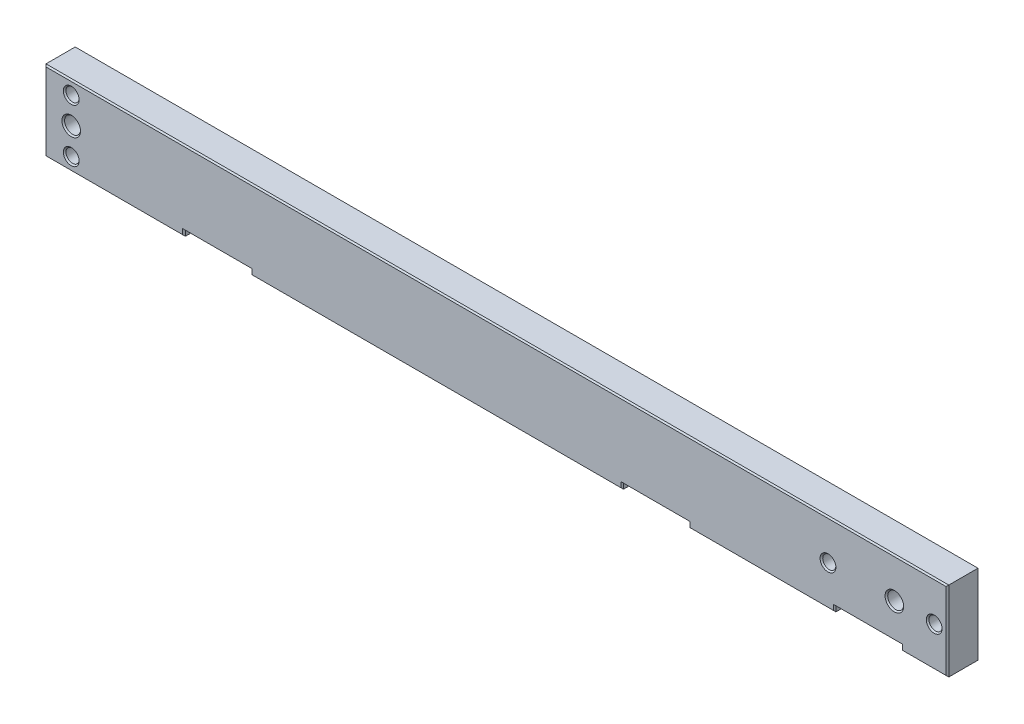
ISO-10303-21;
HEADER;
FILE_DESCRIPTION(('STEP AP214'),'2;1');
FILE_NAME('part.step','',(''),(''),'','','');
FILE_SCHEMA(('AUTOMOTIVE_DESIGN { 1 0 10303 214 1 1 1 1 }'));
ENDSEC;
DATA;
#1=APPLICATION_CONTEXT('core data for automotive mechanical design processes');
#2=APPLICATION_PROTOCOL_DEFINITION('international standard','automotive_design',2000,#1);
#3=PRODUCT_CONTEXT('',#1,'mechanical');
#4=PRODUCT('Part','Part','',(#3));
#5=PRODUCT_RELATED_PRODUCT_CATEGORY('part','',(#4));
#6=PRODUCT_DEFINITION_FORMATION('','',#4);
#7=PRODUCT_DEFINITION_CONTEXT('part definition',#1,'design');
#8=PRODUCT_DEFINITION('design','',#6,#7);
#9=PRODUCT_DEFINITION_SHAPE('','',#8);
#10=(LENGTH_UNIT() NAMED_UNIT(*) SI_UNIT(.MILLI.,.METRE.));
#11=(NAMED_UNIT(*) PLANE_ANGLE_UNIT() SI_UNIT($,.RADIAN.));
#12=(NAMED_UNIT(*) SI_UNIT($,.STERADIAN.) SOLID_ANGLE_UNIT());
#13=UNCERTAINTY_MEASURE_WITH_UNIT(LENGTH_MEASURE(1.E-05),#10,'distance_accuracy_value','');
#14=(GEOMETRIC_REPRESENTATION_CONTEXT(3) GLOBAL_UNCERTAINTY_ASSIGNED_CONTEXT((#13)) GLOBAL_UNIT_ASSIGNED_CONTEXT((#10,
#11,#12)) REPRESENTATION_CONTEXT('',''));
#15=CARTESIAN_POINT('',(0.,0.,0.));
#16=DIRECTION('',(0.,0.,1.));
#17=DIRECTION('',(1.,0.,0.));
#18=AXIS2_PLACEMENT_3D('',#15,#16,#17);
#19=CARTESIAN_POINT('',(322.5,2.,12.));
#20=DIRECTION('',(0.,-1.,0.));
#21=DIRECTION('',(1.,0.,0.));
#22=AXIS2_PLACEMENT_3D('',#19,#20,#21);
#23=PLANE('',#22);
#24=DIRECTION('',(0.,0.,-1.));
#25=VECTOR('',#24,1.);
#26=CARTESIAN_POINT('',(297.5,2.00000000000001,12.));
#27=LINE('',#26,#25);
#28=CARTESIAN_POINT('',(297.5,2.00000000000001,11.5));
#29=VERTEX_POINT('',#28);
#30=CARTESIAN_POINT('',(297.5,2.00000000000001,0.500000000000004));
#31=VERTEX_POINT('',#30);
#32=EDGE_CURVE('E292',#29,#31,#27,.T.);
#33=ORIENTED_EDGE('',*,*,#32,.T.);
#34=DIRECTION('',(1.,0.,0.));
#35=VECTOR('',#34,1.);
#36=CARTESIAN_POINT('',(322.5,2.,0.500000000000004));
#37=LINE('',#36,#35);
#38=CARTESIAN_POINT('',(322.5,2.,0.500000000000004));
#39=VERTEX_POINT('',#38);
#40=EDGE_CURVE('E468',#31,#39,#37,.T.);
#41=ORIENTED_EDGE('',*,*,#40,.T.);
#42=DIRECTION('',(0.,0.,-1.));
#43=VECTOR('',#42,1.);
#44=CARTESIAN_POINT('',(322.5,2.,12.));
#45=LINE('',#44,#43);
#46=CARTESIAN_POINT('',(322.5,2.,11.5));
#47=VERTEX_POINT('',#46);
#48=EDGE_CURVE('E289',#47,#39,#45,.T.);
#49=ORIENTED_EDGE('',*,*,#48,.F.);
#50=DIRECTION('',(-1.,0.,0.));
#51=VECTOR('',#50,1.);
#52=CARTESIAN_POINT('',(297.5,2.00000000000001,11.5));
#53=LINE('',#52,#51);
#54=EDGE_CURVE('E367',#47,#29,#53,.T.);
#55=ORIENTED_EDGE('',*,*,#54,.T.);
#56=EDGE_LOOP('',(#33,#41,#49,#55));
#57=FACE_BOUND('',#56,.T.);
#58=CARTESIAN_POINT('',(310.,2.,6.));
#59=DIRECTION('',(0.,-1.,0.));
#60=DIRECTION('',(1.,0.,0.));
#61=AXIS2_PLACEMENT_3D('',#58,#59,#60);
#62=CIRCLE('',#61,3.99999999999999);
#63=CARTESIAN_POINT('',(314.,2.,6.));
#64=VERTEX_POINT('',#63);
#65=EDGE_CURVE('E328',#64,#64,#62,.F.);
#66=ORIENTED_EDGE('',*,*,#65,.T.);
#67=EDGE_LOOP('',(#66));
#68=FACE_BOUND('',#67,.T.);
#69=ADVANCED_FACE('F34',(#57,#68),#23,.T.);
#70=CARTESIAN_POINT('',(242.5,2.00000000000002,12.));
#71=DIRECTION('',(0.,-1.,0.));
#72=DIRECTION('',(1.,0.,0.));
#73=AXIS2_PLACEMENT_3D('',#70,#71,#72);
#74=PLANE('',#73);
#75=DIRECTION('',(0.,0.,-1.));
#76=VECTOR('',#75,1.);
#77=CARTESIAN_POINT('',(217.5,2.00000000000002,12.));
#78=LINE('',#77,#76);
#79=CARTESIAN_POINT('',(217.5,2.00000000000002,11.5));
#80=VERTEX_POINT('',#79);
#81=CARTESIAN_POINT('',(217.5,2.00000000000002,0.500000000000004));
#82=VERTEX_POINT('',#81);
#83=EDGE_CURVE('E304',#80,#82,#78,.T.);
#84=ORIENTED_EDGE('',*,*,#83,.T.);
#85=DIRECTION('',(1.,0.,0.));
#86=VECTOR('',#85,1.);
#87=CARTESIAN_POINT('',(242.5,2.00000000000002,0.500000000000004));
#88=LINE('',#87,#86);
#89=CARTESIAN_POINT('',(242.5,2.00000000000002,0.500000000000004));
#90=VERTEX_POINT('',#89);
#91=EDGE_CURVE('E460',#82,#90,#88,.T.);
#92=ORIENTED_EDGE('',*,*,#91,.T.);
#93=DIRECTION('',(0.,0.,-1.));
#94=VECTOR('',#93,1.);
#95=CARTESIAN_POINT('',(242.5,2.00000000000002,12.));
#96=LINE('',#95,#94);
#97=CARTESIAN_POINT('',(242.5,2.00000000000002,11.5));
#98=VERTEX_POINT('',#97);
#99=EDGE_CURVE('E301',#98,#90,#96,.T.);
#100=ORIENTED_EDGE('',*,*,#99,.F.);
#101=DIRECTION('',(-1.,0.,0.));
#102=VECTOR('',#101,1.);
#103=CARTESIAN_POINT('',(217.5,2.00000000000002,11.5));
#104=LINE('',#103,#102);
#105=EDGE_CURVE('E375',#98,#80,#104,.T.);
#106=ORIENTED_EDGE('',*,*,#105,.T.);
#107=EDGE_LOOP('',(#84,#92,#100,#106));
#108=FACE_BOUND('',#107,.T.);
#109=CARTESIAN_POINT('',(230.,2.00000000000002,6.));
#110=DIRECTION('',(0.,-1.,0.));
#111=DIRECTION('',(1.,0.,0.));
#112=AXIS2_PLACEMENT_3D('',#109,#110,#111);
#113=CIRCLE('',#112,3.99999999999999);
#114=CARTESIAN_POINT('',(234.,2.00000000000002,6.));
#115=VERTEX_POINT('',#114);
#116=EDGE_CURVE('E324',#115,#115,#113,.F.);
#117=ORIENTED_EDGE('',*,*,#116,.T.);
#118=EDGE_LOOP('',(#117));
#119=FACE_BOUND('',#118,.T.);
#120=ADVANCED_FACE('F547',(#108,#119),#74,.T.);
#121=CARTESIAN_POINT('',(77.5,2.,12.));
#122=DIRECTION('',(0.,-1.,0.));
#123=DIRECTION('',(1.,0.,0.));
#124=AXIS2_PLACEMENT_3D('',#121,#122,#123);
#125=PLANE('',#124);
#126=DIRECTION('',(0.,0.,-1.));
#127=VECTOR('',#126,1.);
#128=CARTESIAN_POINT('',(52.5,2.,12.));
#129=LINE('',#128,#127);
#130=CARTESIAN_POINT('',(52.5,2.,11.5));
#131=VERTEX_POINT('',#130);
#132=CARTESIAN_POINT('',(52.5,2.,0.500000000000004));
#133=VERTEX_POINT('',#132);
#134=EDGE_CURVE('E316',#131,#133,#129,.T.);
#135=ORIENTED_EDGE('',*,*,#134,.T.);
#136=DIRECTION('',(1.,0.,0.));
#137=VECTOR('',#136,1.);
#138=CARTESIAN_POINT('',(77.5,2.,0.500000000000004));
#139=LINE('',#138,#137);
#140=CARTESIAN_POINT('',(77.5,2.,0.500000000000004));
#141=VERTEX_POINT('',#140);
#142=EDGE_CURVE('E452',#133,#141,#139,.T.);
#143=ORIENTED_EDGE('',*,*,#142,.T.);
#144=DIRECTION('',(0.,0.,-1.));
#145=VECTOR('',#144,1.);
#146=CARTESIAN_POINT('',(77.5,2.,12.));
#147=LINE('',#146,#145);
#148=CARTESIAN_POINT('',(77.5,2.,11.5));
#149=VERTEX_POINT('',#148);
#150=EDGE_CURVE('E313',#149,#141,#147,.T.);
#151=ORIENTED_EDGE('',*,*,#150,.F.);
#152=DIRECTION('',(-1.,0.,0.));
#153=VECTOR('',#152,1.);
#154=CARTESIAN_POINT('',(52.5,2.,11.5));
#155=LINE('',#154,#153);
#156=EDGE_CURVE('E383',#149,#131,#155,.T.);
#157=ORIENTED_EDGE('',*,*,#156,.T.);
#158=EDGE_LOOP('',(#135,#143,#151,#157));
#159=FACE_BOUND('',#158,.T.);
#160=CARTESIAN_POINT('',(65.,1.99999999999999,6.));
#161=DIRECTION('',(0.,-1.,0.));
#162=DIRECTION('',(1.,0.,0.));
#163=AXIS2_PLACEMENT_3D('',#160,#161,#162);
#164=CIRCLE('',#163,4.00000000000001);
#165=CARTESIAN_POINT('',(69.,1.99999999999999,6.));
#166=VERTEX_POINT('',#165);
#167=EDGE_CURVE('E280',#166,#166,#164,.F.);
#168=ORIENTED_EDGE('',*,*,#167,.T.);
#169=EDGE_LOOP('',(#168));
#170=FACE_BOUND('',#169,.T.);
#171=ADVANCED_FACE('F553',(#159,#170),#125,.T.);
#172=CARTESIAN_POINT('',(0.,0.,12.));
#173=DIRECTION('',(0.,0.,-1.));
#174=DIRECTION('',(-1.,0.,0.));
#175=AXIS2_PLACEMENT_3D('',#172,#173,#174);
#176=PLANE('',#175);
#177=CARTESIAN_POINT('',(335.,15.,12.));
#178=DIRECTION('',(0.,0.,-1.));
#179=DIRECTION('',(-1.,0.,0.));
#180=AXIS2_PLACEMENT_3D('',#177,#178,#179);
#181=CIRCLE('',#180,2.97500000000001);
#182=CARTESIAN_POINT('',(332.025,15.,12.));
#183=VERTEX_POINT('',#182);
#184=EDGE_CURVE('E519',#183,#183,#181,.T.);
#185=ORIENTED_EDGE('',*,*,#184,.T.);
#186=EDGE_LOOP('',(#185));
#187=FACE_BOUND('',#186,.T.);
#188=CARTESIAN_POINT('',(295.,15.,12.));
#189=DIRECTION('',(0.,0.,-1.));
#190=DIRECTION('',(-1.,0.,0.));
#191=AXIS2_PLACEMENT_3D('',#188,#189,#190);
#192=CIRCLE('',#191,2.97500000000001);
#193=CARTESIAN_POINT('',(292.025,15.,12.));
#194=VERTEX_POINT('',#193);
#195=EDGE_CURVE('E516',#194,#194,#192,.T.);
#196=ORIENTED_EDGE('',*,*,#195,.T.);
#197=EDGE_LOOP('',(#196));
#198=FACE_BOUND('',#197,.T.);
#199=CARTESIAN_POINT('',(320.,15.,12.));
#200=DIRECTION('',(0.,0.,-1.));
#201=DIRECTION('',(-1.,0.,0.));
#202=AXIS2_PLACEMENT_3D('',#199,#200,#201);
#203=CIRCLE('',#202,3.5);
#204=CARTESIAN_POINT('',(316.5,15.,12.));
#205=VERTEX_POINT('',#204);
#206=EDGE_CURVE('E513',#205,#205,#203,.T.);
#207=ORIENTED_EDGE('',*,*,#206,.T.);
#208=EDGE_LOOP('',(#207));
#209=FACE_BOUND('',#208,.T.);
#210=CARTESIAN_POINT('',(10.,5.,12.));
#211=DIRECTION('',(0.,0.,-1.));
#212=DIRECTION('',(-1.,0.,0.));
#213=AXIS2_PLACEMENT_3D('',#210,#211,#212);
#214=CIRCLE('',#213,2.975);
#215=CARTESIAN_POINT('',(7.025,5.,12.));
#216=VERTEX_POINT('',#215);
#217=EDGE_CURVE('E504',#216,#216,#214,.T.);
#218=ORIENTED_EDGE('',*,*,#217,.T.);
#219=EDGE_LOOP('',(#218));
#220=FACE_BOUND('',#219,.T.);
#221=CARTESIAN_POINT('',(10.,15.,12.));
#222=DIRECTION('',(0.,0.,-1.));
#223=DIRECTION('',(-1.,0.,0.));
#224=AXIS2_PLACEMENT_3D('',#221,#222,#223);
#225=CIRCLE('',#224,3.5);
#226=CARTESIAN_POINT('',(6.5,15.,12.));
#227=VERTEX_POINT('',#226);
#228=EDGE_CURVE('E492',#227,#227,#225,.T.);
#229=ORIENTED_EDGE('',*,*,#228,.T.);
#230=EDGE_LOOP('',(#229));
#231=FACE_BOUND('',#230,.T.);
#232=CARTESIAN_POINT('',(10.,25.,12.));
#233=DIRECTION('',(0.,0.,-1.));
#234=DIRECTION('',(-1.,0.,0.));
#235=AXIS2_PLACEMENT_3D('',#232,#233,#234);
#236=CIRCLE('',#235,2.975);
#237=CARTESIAN_POINT('',(7.025,25.,12.));
#238=VERTEX_POINT('',#237);
#239=EDGE_CURVE('E489',#238,#238,#236,.T.);
#240=ORIENTED_EDGE('',*,*,#239,.T.);
#241=EDGE_LOOP('',(#240));
#242=FACE_BOUND('',#241,.T.);
#243=DIRECTION('',(-1.,0.,0.));
#244=VECTOR('',#243,1.);
#245=CARTESIAN_POINT('',(0.,29.5,12.));
#246=LINE('',#245,#244);
#247=CARTESIAN_POINT('',(339.5,29.5,12.));
#248=VERTEX_POINT('',#247);
#249=CARTESIAN_POINT('',(0.500000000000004,29.5,12.));
#250=VERTEX_POINT('',#249);
#251=EDGE_CURVE('E359',#248,#250,#246,.T.);
#252=ORIENTED_EDGE('',*,*,#251,.T.);
#253=DIRECTION('',(0.,-1.,0.));
#254=VECTOR('',#253,1.);
#255=CARTESIAN_POINT('',(0.500000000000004,0.,12.));
#256=LINE('',#255,#254);
#257=CARTESIAN_POINT('',(0.500000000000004,0.500000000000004,12.));
#258=VERTEX_POINT('',#257);
#259=EDGE_CURVE('E253',#250,#258,#256,.T.);
#260=ORIENTED_EDGE('',*,*,#259,.T.);
#261=DIRECTION('',(1.,0.,0.));
#262=VECTOR('',#261,1.);
#263=CARTESIAN_POINT('',(52.5,0.499999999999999,12.));
#264=LINE('',#263,#262);
#265=CARTESIAN_POINT('',(52.,0.499999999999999,12.));
#266=VERTEX_POINT('',#265);
#267=EDGE_CURVE('E272',#258,#266,#264,.T.);
#268=ORIENTED_EDGE('',*,*,#267,.T.);
#269=DIRECTION('',(0.,1.,0.));
#270=VECTOR('',#269,1.);
#271=CARTESIAN_POINT('',(52.,2.,12.));
#272=LINE('',#271,#270);
#273=CARTESIAN_POINT('',(52.,2.5,12.));
#274=VERTEX_POINT('',#273);
#275=EDGE_CURVE('E333',#266,#274,#272,.T.);
#276=ORIENTED_EDGE('',*,*,#275,.T.);
#277=DIRECTION('',(1.,0.,0.));
#278=VECTOR('',#277,1.);
#279=CARTESIAN_POINT('',(77.5,2.5,12.));
#280=LINE('',#279,#278);
#281=CARTESIAN_POINT('',(78.,2.5,12.));
#282=VERTEX_POINT('',#281);
#283=EDGE_CURVE('E335',#274,#282,#280,.T.);
#284=ORIENTED_EDGE('',*,*,#283,.T.);
#285=DIRECTION('',(0.,-1.,0.));
#286=VECTOR('',#285,1.);
#287=CARTESIAN_POINT('',(78.,0.,12.));
#288=LINE('',#287,#286);
#289=CARTESIAN_POINT('',(78.,0.499999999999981,12.));
#290=VERTEX_POINT('',#289);
#291=EDGE_CURVE('E337',#282,#290,#288,.T.);
#292=ORIENTED_EDGE('',*,*,#291,.T.);
#293=DIRECTION('',(1.,0.,0.));
#294=VECTOR('',#293,1.);
#295=CARTESIAN_POINT('',(217.5,0.499999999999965,12.));
#296=LINE('',#295,#294);
#297=CARTESIAN_POINT('',(217.,0.499999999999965,12.));
#298=VERTEX_POINT('',#297);
#299=EDGE_CURVE('E339',#290,#298,#296,.T.);
#300=ORIENTED_EDGE('',*,*,#299,.T.);
#301=DIRECTION('',(0.,1.,0.));
#302=VECTOR('',#301,1.);
#303=CARTESIAN_POINT('',(217.,2.00000000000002,12.));
#304=LINE('',#303,#302);
#305=CARTESIAN_POINT('',(217.,2.50000000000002,12.));
#306=VERTEX_POINT('',#305);
#307=EDGE_CURVE('E341',#298,#306,#304,.T.);
#308=ORIENTED_EDGE('',*,*,#307,.T.);
#309=DIRECTION('',(1.,0.,0.));
#310=VECTOR('',#309,1.);
#311=CARTESIAN_POINT('',(242.5,2.50000000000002,12.));
#312=LINE('',#311,#310);
#313=CARTESIAN_POINT('',(243.,2.50000000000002,12.));
#314=VERTEX_POINT('',#313);
#315=EDGE_CURVE('E343',#306,#314,#312,.T.);
#316=ORIENTED_EDGE('',*,*,#315,.T.);
#317=DIRECTION('',(0.,-1.,0.));
#318=VECTOR('',#317,1.);
#319=CARTESIAN_POINT('',(243.,0.,12.));
#320=LINE('',#319,#318);
#321=CARTESIAN_POINT('',(243.,0.500000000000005,12.));
#322=VERTEX_POINT('',#321);
#323=EDGE_CURVE('E345',#314,#322,#320,.T.);
#324=ORIENTED_EDGE('',*,*,#323,.T.);
#325=DIRECTION('',(1.,0.,0.));
#326=VECTOR('',#325,1.);
#327=CARTESIAN_POINT('',(297.5,0.500000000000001,12.));
#328=LINE('',#327,#326);
#329=CARTESIAN_POINT('',(297.,0.500000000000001,12.));
#330=VERTEX_POINT('',#329);
#331=EDGE_CURVE('E347',#322,#330,#328,.T.);
#332=ORIENTED_EDGE('',*,*,#331,.T.);
#333=DIRECTION('',(0.,1.,0.));
#334=VECTOR('',#333,1.);
#335=CARTESIAN_POINT('',(297.,2.00000000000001,12.));
#336=LINE('',#335,#334);
#337=CARTESIAN_POINT('',(297.,2.50000000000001,12.));
#338=VERTEX_POINT('',#337);
#339=EDGE_CURVE('E349',#330,#338,#336,.T.);
#340=ORIENTED_EDGE('',*,*,#339,.T.);
#341=DIRECTION('',(1.,0.,0.));
#342=VECTOR('',#341,1.);
#343=CARTESIAN_POINT('',(322.5,2.50000000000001,12.));
#344=LINE('',#343,#342);
#345=CARTESIAN_POINT('',(323.,2.50000000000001,12.));
#346=VERTEX_POINT('',#345);
#347=EDGE_CURVE('E351',#338,#346,#344,.T.);
#348=ORIENTED_EDGE('',*,*,#347,.T.);
#349=DIRECTION('',(0.,-1.,0.));
#350=VECTOR('',#349,1.);
#351=CARTESIAN_POINT('',(323.,0.,12.));
#352=LINE('',#351,#350);
#353=CARTESIAN_POINT('',(323.,0.500000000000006,12.));
#354=VERTEX_POINT('',#353);
#355=EDGE_CURVE('E353',#346,#354,#352,.T.);
#356=ORIENTED_EDGE('',*,*,#355,.T.);
#357=DIRECTION('',(1.,0.,0.));
#358=VECTOR('',#357,1.);
#359=CARTESIAN_POINT('',(340.,0.500000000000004,12.));
#360=LINE('',#359,#358);
#361=CARTESIAN_POINT('',(339.5,0.500000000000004,12.));
#362=VERTEX_POINT('',#361);
#363=EDGE_CURVE('E355',#354,#362,#360,.T.);
#364=ORIENTED_EDGE('',*,*,#363,.T.);
#365=DIRECTION('',(0.,1.,0.));
#366=VECTOR('',#365,1.);
#367=CARTESIAN_POINT('',(339.5,30.,12.));
#368=LINE('',#367,#366);
#369=EDGE_CURVE('E357',#362,#248,#368,.T.);
#370=ORIENTED_EDGE('',*,*,#369,.T.);
#371=EDGE_LOOP('',(#252,#260,#268,#276,#284,#292,#300,#308,#316,#324,#332,#340,#348,#356,#364,#370));
#372=FACE_BOUND('',#371,.T.);
#373=ADVANCED_FACE('F585',(#187,#198,#209,#220,#231,#242,#372),#176,.F.);
#374=CARTESIAN_POINT('',(0.,0.,0.));
#375=DIRECTION('',(0.,0.,-1.));
#376=DIRECTION('',(-1.,0.,0.));
#377=AXIS2_PLACEMENT_3D('',#374,#375,#376);
#378=PLANE('',#377);
#379=CARTESIAN_POINT('',(10.,5.,0.));
#380=DIRECTION('',(0.,0.,-1.));
#381=DIRECTION('',(-1.,0.,0.));
#382=AXIS2_PLACEMENT_3D('',#379,#380,#381);
#383=CIRCLE('',#382,2.97500000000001);
#384=CARTESIAN_POINT('',(7.02499999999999,5.,0.));
#385=VERTEX_POINT('',#384);
#386=EDGE_CURVE('E437',#385,#385,#383,.F.);
#387=ORIENTED_EDGE('',*,*,#386,.T.);
#388=EDGE_LOOP('',(#387));
#389=FACE_BOUND('',#388,.T.);
#390=CARTESIAN_POINT('',(10.,25.,0.));
#391=DIRECTION('',(0.,0.,-1.));
#392=DIRECTION('',(-1.,0.,0.));
#393=AXIS2_PLACEMENT_3D('',#390,#391,#392);
#394=CIRCLE('',#393,2.97500000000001);
#395=CARTESIAN_POINT('',(7.02499999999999,25.,0.));
#396=VERTEX_POINT('',#395);
#397=EDGE_CURVE('E434',#396,#396,#394,.F.);
#398=ORIENTED_EDGE('',*,*,#397,.T.);
#399=EDGE_LOOP('',(#398));
#400=FACE_BOUND('',#399,.T.);
#401=CARTESIAN_POINT('',(295.,15.,0.));
#402=DIRECTION('',(0.,0.,-1.));
#403=DIRECTION('',(-1.,0.,0.));
#404=AXIS2_PLACEMENT_3D('',#401,#402,#403);
#405=CIRCLE('',#404,2.97500000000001);
#406=CARTESIAN_POINT('',(292.025,15.,0.));
#407=VERTEX_POINT('',#406);
#408=EDGE_CURVE('E431',#407,#407,#405,.F.);
#409=ORIENTED_EDGE('',*,*,#408,.T.);
#410=EDGE_LOOP('',(#409));
#411=FACE_BOUND('',#410,.T.);
#412=DIRECTION('',(-1.,0.,0.));
#413=VECTOR('',#412,1.);
#414=CARTESIAN_POINT('',(0.,2.50000000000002,0.));
#415=LINE('',#414,#413);
#416=CARTESIAN_POINT('',(78.,2.5,0.));
#417=VERTEX_POINT('',#416);
#418=CARTESIAN_POINT('',(52.,2.50000000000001,0.));
#419=VERTEX_POINT('',#418);
#420=EDGE_CURVE('E426',#417,#419,#415,.T.);
#421=ORIENTED_EDGE('',*,*,#420,.T.);
#422=DIRECTION('',(0.,-1.,0.));
#423=VECTOR('',#422,1.);
#424=CARTESIAN_POINT('',(52.,0.,0.));
#425=LINE('',#424,#423);
#426=CARTESIAN_POINT('',(52.,0.500000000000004,0.));
#427=VERTEX_POINT('',#426);
#428=EDGE_CURVE('E428',#419,#427,#425,.T.);
#429=ORIENTED_EDGE('',*,*,#428,.T.);
#430=DIRECTION('',(-1.,0.,0.));
#431=VECTOR('',#430,1.);
#432=CARTESIAN_POINT('',(0.,0.500000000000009,0.));
#433=LINE('',#432,#431);
#434=CARTESIAN_POINT('',(0.500000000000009,0.500000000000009,0.));
#435=VERTEX_POINT('',#434);
#436=EDGE_CURVE('E398',#427,#435,#433,.T.);
#437=ORIENTED_EDGE('',*,*,#436,.T.);
#438=DIRECTION('',(0.,1.,0.));
#439=VECTOR('',#438,1.);
#440=CARTESIAN_POINT('',(0.500000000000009,0.,0.));
#441=LINE('',#440,#439);
#442=CARTESIAN_POINT('',(0.500000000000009,29.5,0.));
#443=VERTEX_POINT('',#442);
#444=EDGE_CURVE('E400',#435,#443,#441,.T.);
#445=ORIENTED_EDGE('',*,*,#444,.T.);
#446=DIRECTION('',(1.,0.,0.));
#447=VECTOR('',#446,1.);
#448=CARTESIAN_POINT('',(0.,29.5,0.));
#449=LINE('',#448,#447);
#450=CARTESIAN_POINT('',(339.5,29.5,0.));
#451=VERTEX_POINT('',#450);
#452=EDGE_CURVE('E402',#443,#451,#449,.T.);
#453=ORIENTED_EDGE('',*,*,#452,.T.);
#454=DIRECTION('',(0.,-1.,0.));
#455=VECTOR('',#454,1.);
#456=CARTESIAN_POINT('',(339.5,0.,0.));
#457=LINE('',#456,#455);
#458=CARTESIAN_POINT('',(339.5,0.500000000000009,0.));
#459=VERTEX_POINT('',#458);
#460=EDGE_CURVE('E404',#451,#459,#457,.T.);
#461=ORIENTED_EDGE('',*,*,#460,.T.);
#462=DIRECTION('',(-1.,0.,0.));
#463=VECTOR('',#462,1.);
#464=CARTESIAN_POINT('',(0.,0.50000000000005,0.));
#465=LINE('',#464,#463);
#466=CARTESIAN_POINT('',(323.,0.500000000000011,0.));
#467=VERTEX_POINT('',#466);
#468=EDGE_CURVE('E406',#459,#467,#465,.T.);
#469=ORIENTED_EDGE('',*,*,#468,.T.);
#470=DIRECTION('',(0.,1.,0.));
#471=VECTOR('',#470,1.);
#472=CARTESIAN_POINT('',(323.,0.,0.));
#473=LINE('',#472,#471);
#474=CARTESIAN_POINT('',(323.,2.50000000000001,0.));
#475=VERTEX_POINT('',#474);
#476=EDGE_CURVE('E408',#467,#475,#473,.T.);
#477=ORIENTED_EDGE('',*,*,#476,.T.);
#478=DIRECTION('',(-1.,0.,0.));
#479=VECTOR('',#478,1.);
#480=CARTESIAN_POINT('',(0.,2.50000000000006,0.));
#481=LINE('',#480,#479);
#482=CARTESIAN_POINT('',(297.,2.50000000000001,0.));
#483=VERTEX_POINT('',#482);
#484=EDGE_CURVE('E410',#475,#483,#481,.T.);
#485=ORIENTED_EDGE('',*,*,#484,.T.);
#486=DIRECTION('',(0.,-1.,0.));
#487=VECTOR('',#486,1.);
#488=CARTESIAN_POINT('',(297.,0.,0.));
#489=LINE('',#488,#487);
#490=CARTESIAN_POINT('',(297.,0.500000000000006,0.));
#491=VERTEX_POINT('',#490);
#492=EDGE_CURVE('E412',#483,#491,#489,.T.);
#493=ORIENTED_EDGE('',*,*,#492,.T.);
#494=DIRECTION('',(-1.,0.,0.));
#495=VECTOR('',#494,1.);
#496=CARTESIAN_POINT('',(0.,0.500000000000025,0.));
#497=LINE('',#496,#495);
#498=CARTESIAN_POINT('',(243.,0.50000000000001,0.));
#499=VERTEX_POINT('',#498);
#500=EDGE_CURVE('E414',#491,#499,#497,.T.);
#501=ORIENTED_EDGE('',*,*,#500,.T.);
#502=DIRECTION('',(0.,1.,0.));
#503=VECTOR('',#502,1.);
#504=CARTESIAN_POINT('',(243.,0.,0.));
#505=LINE('',#504,#503);
#506=CARTESIAN_POINT('',(243.,2.50000000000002,0.));
#507=VERTEX_POINT('',#506);
#508=EDGE_CURVE('E416',#499,#507,#505,.T.);
#509=ORIENTED_EDGE('',*,*,#508,.T.);
#510=DIRECTION('',(-1.,0.,0.));
#511=VECTOR('',#510,1.);
#512=CARTESIAN_POINT('',(0.,2.50000000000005,0.));
#513=LINE('',#512,#511);
#514=CARTESIAN_POINT('',(217.,2.50000000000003,0.));
#515=VERTEX_POINT('',#514);
#516=EDGE_CURVE('E418',#507,#515,#513,.T.);
#517=ORIENTED_EDGE('',*,*,#516,.T.);
#518=DIRECTION('',(0.,-1.,0.));
#519=VECTOR('',#518,1.);
#520=CARTESIAN_POINT('',(217.,0.,0.));
#521=LINE('',#520,#519);
#522=CARTESIAN_POINT('',(217.,0.49999999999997,0.));
#523=VERTEX_POINT('',#522);
#524=EDGE_CURVE('E420',#515,#523,#521,.T.);
#525=ORIENTED_EDGE('',*,*,#524,.T.);
#526=DIRECTION('',(-1.,0.,0.));
#527=VECTOR('',#526,1.);
#528=CARTESIAN_POINT('',(0.,0.499999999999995,0.));
#529=LINE('',#528,#527);
#530=CARTESIAN_POINT('',(78.,0.499999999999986,0.));
#531=VERTEX_POINT('',#530);
#532=EDGE_CURVE('E422',#523,#531,#529,.T.);
#533=ORIENTED_EDGE('',*,*,#532,.T.);
#534=DIRECTION('',(0.,1.,0.));
#535=VECTOR('',#534,1.);
#536=CARTESIAN_POINT('',(78.,0.,0.));
#537=LINE('',#536,#535);
#538=EDGE_CURVE('E424',#531,#417,#537,.T.);
#539=ORIENTED_EDGE('',*,*,#538,.T.);
#540=EDGE_LOOP('',(#421,#429,#437,#445,#453,#461,#469,#477,#485,#493,#501,#509,#517,#525,#533,#539));
#541=FACE_BOUND('',#540,.T.);
#542=CARTESIAN_POINT('',(335.,15.,0.));
#543=DIRECTION('',(0.,0.,-1.));
#544=DIRECTION('',(-1.,0.,0.));
#545=AXIS2_PLACEMENT_3D('',#542,#543,#544);
#546=CIRCLE('',#545,2.97500000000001);
#547=CARTESIAN_POINT('',(332.025,15.,0.));
#548=VERTEX_POINT('',#547);
#549=EDGE_CURVE('E395',#548,#548,#546,.F.);
#550=ORIENTED_EDGE('',*,*,#549,.T.);
#551=EDGE_LOOP('',(#550));
#552=FACE_BOUND('',#551,.T.);
#553=CARTESIAN_POINT('',(320.,15.,0.));
#554=DIRECTION('',(0.,0.,-1.));
#555=DIRECTION('',(-1.,0.,0.));
#556=AXIS2_PLACEMENT_3D('',#553,#554,#555);
#557=CIRCLE('',#556,3.5);
#558=CARTESIAN_POINT('',(316.5,15.,0.));
#559=VERTEX_POINT('',#558);
#560=EDGE_CURVE('E392',#559,#559,#557,.F.);
#561=ORIENTED_EDGE('',*,*,#560,.T.);
#562=EDGE_LOOP('',(#561));
#563=FACE_BOUND('',#562,.T.);
#564=CARTESIAN_POINT('',(10.,15.,0.));
#565=DIRECTION('',(0.,0.,-1.));
#566=DIRECTION('',(-1.,0.,0.));
#567=AXIS2_PLACEMENT_3D('',#564,#565,#566);
#568=CIRCLE('',#567,3.50000000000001);
#569=CARTESIAN_POINT('',(6.49999999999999,15.,0.));
#570=VERTEX_POINT('',#569);
#571=EDGE_CURVE('E389',#570,#570,#568,.F.);
#572=ORIENTED_EDGE('',*,*,#571,.T.);
#573=EDGE_LOOP('',(#572));
#574=FACE_BOUND('',#573,.T.);
#575=ADVANCED_FACE('F590',(#389,#400,#411,#541,#552,#563,#574),#378,.T.);
#576=CARTESIAN_POINT('',(52.5,0.,12.));
#577=DIRECTION('',(0.,-1.,0.));
#578=DIRECTION('',(1.,0.,0.));
#579=AXIS2_PLACEMENT_3D('',#576,#577,#578);
#580=PLANE('',#579);
#581=DIRECTION('',(0.,0.,-1.));
#582=VECTOR('',#581,1.);
#583=CARTESIAN_POINT('',(0.,0.,12.));
#584=LINE('',#583,#582);
#585=CARTESIAN_POINT('',(0.,0.,11.5));
#586=VERTEX_POINT('',#585);
#587=CARTESIAN_POINT('',(0.,0.,0.500000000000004));
#588=VERTEX_POINT('',#587);
#589=EDGE_CURVE('E270',#586,#588,#584,.T.);
#590=ORIENTED_EDGE('',*,*,#589,.T.);
#591=DIRECTION('',(1.,0.,0.));
#592=VECTOR('',#591,1.);
#593=CARTESIAN_POINT('',(52.5,0.,0.500000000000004));
#594=LINE('',#593,#592);
#595=CARTESIAN_POINT('',(52.5,0.,0.500000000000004));
#596=VERTEX_POINT('',#595);
#597=EDGE_CURVE('E478',#588,#596,#594,.T.);
#598=ORIENTED_EDGE('',*,*,#597,.T.);
#599=DIRECTION('',(0.,0.,-1.));
#600=VECTOR('',#599,1.);
#601=CARTESIAN_POINT('',(52.5,0.,12.));
#602=LINE('',#601,#600);
#603=CARTESIAN_POINT('',(52.5,0.,11.5));
#604=VERTEX_POINT('',#603);
#605=EDGE_CURVE('E273',#604,#596,#602,.T.);
#606=ORIENTED_EDGE('',*,*,#605,.F.);
#607=DIRECTION('',(-1.,0.,0.));
#608=VECTOR('',#607,1.);
#609=CARTESIAN_POINT('',(0.,0.,11.5));
#610=LINE('',#609,#608);
#611=EDGE_CURVE('E387',#604,#586,#610,.T.);
#612=ORIENTED_EDGE('',*,*,#611,.T.);
#613=EDGE_LOOP('',(#590,#598,#606,#612));
#614=FACE_BOUND('',#613,.T.);
#615=ADVANCED_FACE('F724',(#614),#580,.T.);
#616=CARTESIAN_POINT('',(52.5,2.,12.));
#617=DIRECTION('',(1.,0.,0.));
#618=DIRECTION('',(0.,0.,-1.));
#619=AXIS2_PLACEMENT_3D('',#616,#617,#618);
#620=PLANE('',#619);
#621=ORIENTED_EDGE('',*,*,#605,.T.);
#622=DIRECTION('',(0.,1.,0.));
#623=VECTOR('',#622,1.);
#624=CARTESIAN_POINT('',(52.5,2.,0.500000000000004));
#625=LINE('',#624,#623);
#626=EDGE_CURVE('E449',#596,#133,#625,.T.);
#627=ORIENTED_EDGE('',*,*,#626,.T.);
#628=ORIENTED_EDGE('',*,*,#134,.F.);
#629=DIRECTION('',(0.,-1.,0.));
#630=VECTOR('',#629,1.);
#631=CARTESIAN_POINT('',(52.5,0.,11.5));
#632=LINE('',#631,#630);
#633=EDGE_CURVE('E385',#131,#604,#632,.T.);
#634=ORIENTED_EDGE('',*,*,#633,.T.);
#635=EDGE_LOOP('',(#621,#627,#628,#634));
#636=FACE_BOUND('',#635,.T.);
#637=ADVANCED_FACE('F36',(#636),#620,.T.);
#638=CARTESIAN_POINT('',(77.5,0.,12.));
#639=DIRECTION('',(-1.,0.,0.));
#640=DIRECTION('',(0.,0.,1.));
#641=AXIS2_PLACEMENT_3D('',#638,#639,#640);
#642=PLANE('',#641);
#643=ORIENTED_EDGE('',*,*,#150,.T.);
#644=DIRECTION('',(0.,-1.,0.));
#645=VECTOR('',#644,1.);
#646=CARTESIAN_POINT('',(77.5,0.,0.500000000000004));
#647=LINE('',#646,#645);
#648=CARTESIAN_POINT('',(77.5,0.,0.500000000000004));
#649=VERTEX_POINT('',#648);
#650=EDGE_CURVE('E454',#141,#649,#647,.T.);
#651=ORIENTED_EDGE('',*,*,#650,.T.);
#652=DIRECTION('',(0.,0.,-1.));
#653=VECTOR('',#652,1.);
#654=CARTESIAN_POINT('',(77.5,0.,12.));
#655=LINE('',#654,#653);
#656=CARTESIAN_POINT('',(77.5,0.,11.5));
#657=VERTEX_POINT('',#656);
#658=EDGE_CURVE('E310',#657,#649,#655,.T.);
#659=ORIENTED_EDGE('',*,*,#658,.F.);
#660=DIRECTION('',(0.,1.,0.));
#661=VECTOR('',#660,1.);
#662=CARTESIAN_POINT('',(77.5,2.,11.5));
#663=LINE('',#662,#661);
#664=EDGE_CURVE('E381',#657,#149,#663,.T.);
#665=ORIENTED_EDGE('',*,*,#664,.T.);
#666=EDGE_LOOP('',(#643,#651,#659,#665));
#667=FACE_BOUND('',#666,.T.);
#668=ADVANCED_FACE('F580',(#667),#642,.T.);
#669=CARTESIAN_POINT('',(217.5,0.,12.));
#670=DIRECTION('',(0.,-1.,0.));
#671=DIRECTION('',(1.,0.,0.));
#672=AXIS2_PLACEMENT_3D('',#669,#670,#671);
#673=PLANE('',#672);
#674=ORIENTED_EDGE('',*,*,#658,.T.);
#675=DIRECTION('',(1.,0.,0.));
#676=VECTOR('',#675,1.);
#677=CARTESIAN_POINT('',(217.5,0.,0.500000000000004));
#678=LINE('',#677,#676);
#679=CARTESIAN_POINT('',(217.5,0.,0.500000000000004));
#680=VERTEX_POINT('',#679);
#681=EDGE_CURVE('E456',#649,#680,#678,.T.);
#682=ORIENTED_EDGE('',*,*,#681,.T.);
#683=DIRECTION('',(0.,0.,-1.));
#684=VECTOR('',#683,1.);
#685=CARTESIAN_POINT('',(217.5,0.,12.));
#686=LINE('',#685,#684);
#687=CARTESIAN_POINT('',(217.5,0.,11.5));
#688=VERTEX_POINT('',#687);
#689=EDGE_CURVE('E307',#688,#680,#686,.T.);
#690=ORIENTED_EDGE('',*,*,#689,.F.);
#691=DIRECTION('',(-1.,0.,0.));
#692=VECTOR('',#691,1.);
#693=CARTESIAN_POINT('',(77.5,0.,11.5));
#694=LINE('',#693,#692);
#695=EDGE_CURVE('E379',#688,#657,#694,.T.);
#696=ORIENTED_EDGE('',*,*,#695,.T.);
#697=EDGE_LOOP('',(#674,#682,#690,#696));
#698=FACE_BOUND('',#697,.T.);
#699=ADVANCED_FACE('F576',(#698),#673,.T.);
#700=CARTESIAN_POINT('',(217.5,2.00000000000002,12.));
#701=DIRECTION('',(1.,0.,0.));
#702=DIRECTION('',(0.,0.,-1.));
#703=AXIS2_PLACEMENT_3D('',#700,#701,#702);
#704=PLANE('',#703);
#705=ORIENTED_EDGE('',*,*,#689,.T.);
#706=DIRECTION('',(0.,1.,0.));
#707=VECTOR('',#706,1.);
#708=CARTESIAN_POINT('',(217.5,2.00000000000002,0.500000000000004));
#709=LINE('',#708,#707);
#710=EDGE_CURVE('E458',#680,#82,#709,.T.);
#711=ORIENTED_EDGE('',*,*,#710,.T.);
#712=ORIENTED_EDGE('',*,*,#83,.F.);
#713=DIRECTION('',(0.,-1.,0.));
#714=VECTOR('',#713,1.);
#715=CARTESIAN_POINT('',(217.5,0.,11.5));
#716=LINE('',#715,#714);
#717=EDGE_CURVE('E377',#80,#688,#716,.T.);
#718=ORIENTED_EDGE('',*,*,#717,.T.);
#719=EDGE_LOOP('',(#705,#711,#712,#718));
#720=FACE_BOUND('',#719,.T.);
#721=ADVANCED_FACE('F571',(#720),#704,.T.);
#722=CARTESIAN_POINT('',(242.5,0.,12.));
#723=DIRECTION('',(-1.,0.,0.));
#724=DIRECTION('',(0.,0.,1.));
#725=AXIS2_PLACEMENT_3D('',#722,#723,#724);
#726=PLANE('',#725);
#727=ORIENTED_EDGE('',*,*,#99,.T.);
#728=DIRECTION('',(0.,-1.,0.));
#729=VECTOR('',#728,1.);
#730=CARTESIAN_POINT('',(242.5,0.,0.500000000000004));
#731=LINE('',#730,#729);
#732=CARTESIAN_POINT('',(242.5,0.,0.500000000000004));
#733=VERTEX_POINT('',#732);
#734=EDGE_CURVE('E462',#90,#733,#731,.T.);
#735=ORIENTED_EDGE('',*,*,#734,.T.);
#736=DIRECTION('',(0.,0.,-1.));
#737=VECTOR('',#736,1.);
#738=CARTESIAN_POINT('',(242.5,0.,12.));
#739=LINE('',#738,#737);
#740=CARTESIAN_POINT('',(242.5,0.,11.5));
#741=VERTEX_POINT('',#740);
#742=EDGE_CURVE('E298',#741,#733,#739,.T.);
#743=ORIENTED_EDGE('',*,*,#742,.F.);
#744=DIRECTION('',(0.,1.,0.));
#745=VECTOR('',#744,1.);
#746=CARTESIAN_POINT('',(242.5,2.00000000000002,11.5));
#747=LINE('',#746,#745);
#748=EDGE_CURVE('E373',#741,#98,#747,.T.);
#749=ORIENTED_EDGE('',*,*,#748,.T.);
#750=EDGE_LOOP('',(#727,#735,#743,#749));
#751=FACE_BOUND('',#750,.T.);
#752=ADVANCED_FACE('F568',(#751),#726,.T.);
#753=CARTESIAN_POINT('',(297.5,0.,12.));
#754=DIRECTION('',(0.,-1.,0.));
#755=DIRECTION('',(1.,0.,0.));
#756=AXIS2_PLACEMENT_3D('',#753,#754,#755);
#757=PLANE('',#756);
#758=ORIENTED_EDGE('',*,*,#742,.T.);
#759=DIRECTION('',(1.,0.,0.));
#760=VECTOR('',#759,1.);
#761=CARTESIAN_POINT('',(297.5,0.,0.500000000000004));
#762=LINE('',#761,#760);
#763=CARTESIAN_POINT('',(297.5,0.,0.500000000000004));
#764=VERTEX_POINT('',#763);
#765=EDGE_CURVE('E464',#733,#764,#762,.T.);
#766=ORIENTED_EDGE('',*,*,#765,.T.);
#767=DIRECTION('',(0.,0.,-1.));
#768=VECTOR('',#767,1.);
#769=CARTESIAN_POINT('',(297.5,0.,12.));
#770=LINE('',#769,#768);
#771=CARTESIAN_POINT('',(297.5,0.,11.5));
#772=VERTEX_POINT('',#771);
#773=EDGE_CURVE('E295',#772,#764,#770,.T.);
#774=ORIENTED_EDGE('',*,*,#773,.F.);
#775=DIRECTION('',(-1.,0.,0.));
#776=VECTOR('',#775,1.);
#777=CARTESIAN_POINT('',(242.5,0.,11.5));
#778=LINE('',#777,#776);
#779=EDGE_CURVE('E371',#772,#741,#778,.T.);
#780=ORIENTED_EDGE('',*,*,#779,.T.);
#781=EDGE_LOOP('',(#758,#766,#774,#780));
#782=FACE_BOUND('',#781,.T.);
#783=ADVANCED_FACE('F564',(#782),#757,.T.);
#784=CARTESIAN_POINT('',(297.5,2.00000000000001,12.));
#785=DIRECTION('',(1.,0.,0.));
#786=DIRECTION('',(0.,0.,-1.));
#787=AXIS2_PLACEMENT_3D('',#784,#785,#786);
#788=PLANE('',#787);
#789=ORIENTED_EDGE('',*,*,#773,.T.);
#790=DIRECTION('',(0.,1.,0.));
#791=VECTOR('',#790,1.);
#792=CARTESIAN_POINT('',(297.5,2.00000000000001,0.500000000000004));
#793=LINE('',#792,#791);
#794=EDGE_CURVE('E466',#764,#31,#793,.T.);
#795=ORIENTED_EDGE('',*,*,#794,.T.);
#796=ORIENTED_EDGE('',*,*,#32,.F.);
#797=DIRECTION('',(0.,-1.,0.));
#798=VECTOR('',#797,1.);
#799=CARTESIAN_POINT('',(297.5,0.,11.5));
#800=LINE('',#799,#798);
#801=EDGE_CURVE('E369',#29,#772,#800,.T.);
#802=ORIENTED_EDGE('',*,*,#801,.T.);
#803=EDGE_LOOP('',(#789,#795,#796,#802));
#804=FACE_BOUND('',#803,.T.);
#805=ADVANCED_FACE('F561',(#804),#788,.T.);
#806=CARTESIAN_POINT('',(322.5,0.,12.));
#807=DIRECTION('',(-1.,0.,0.));
#808=DIRECTION('',(0.,0.,1.));
#809=AXIS2_PLACEMENT_3D('',#806,#807,#808);
#810=PLANE('',#809);
#811=ORIENTED_EDGE('',*,*,#48,.T.);
#812=DIRECTION('',(0.,-1.,0.));
#813=VECTOR('',#812,1.);
#814=CARTESIAN_POINT('',(322.5,0.,0.500000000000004));
#815=LINE('',#814,#813);
#816=CARTESIAN_POINT('',(322.5,0.,0.500000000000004));
#817=VERTEX_POINT('',#816);
#818=EDGE_CURVE('E470',#39,#817,#815,.T.);
#819=ORIENTED_EDGE('',*,*,#818,.T.);
#820=DIRECTION('',(0.,0.,-1.));
#821=VECTOR('',#820,1.);
#822=CARTESIAN_POINT('',(322.5,0.,12.));
#823=LINE('',#822,#821);
#824=CARTESIAN_POINT('',(322.5,0.,11.5));
#825=VERTEX_POINT('',#824);
#826=EDGE_CURVE('E286',#825,#817,#823,.T.);
#827=ORIENTED_EDGE('',*,*,#826,.F.);
#828=DIRECTION('',(0.,1.,0.));
#829=VECTOR('',#828,1.);
#830=CARTESIAN_POINT('',(322.5,2.,11.5));
#831=LINE('',#830,#829);
#832=EDGE_CURVE('E365',#825,#47,#831,.T.);
#833=ORIENTED_EDGE('',*,*,#832,.T.);
#834=EDGE_LOOP('',(#811,#819,#827,#833));
#835=FACE_BOUND('',#834,.T.);
#836=ADVANCED_FACE('F559',(#835),#810,.T.);
#837=CARTESIAN_POINT('',(340.,0.,12.));
#838=DIRECTION('',(0.,-1.,0.));
#839=DIRECTION('',(1.,0.,0.));
#840=AXIS2_PLACEMENT_3D('',#837,#838,#839);
#841=PLANE('',#840);
#842=ORIENTED_EDGE('',*,*,#826,.T.);
#843=DIRECTION('',(1.,0.,0.));
#844=VECTOR('',#843,1.);
#845=CARTESIAN_POINT('',(340.,0.,0.500000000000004));
#846=LINE('',#845,#844);
#847=CARTESIAN_POINT('',(340.,0.,0.500000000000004));
#848=VERTEX_POINT('',#847);
#849=EDGE_CURVE('E472',#817,#848,#846,.T.);
#850=ORIENTED_EDGE('',*,*,#849,.T.);
#851=DIRECTION('',(0.,0.,-1.));
#852=VECTOR('',#851,1.);
#853=CARTESIAN_POINT('',(340.,0.,12.));
#854=LINE('',#853,#852);
#855=CARTESIAN_POINT('',(340.,0.,11.5));
#856=VERTEX_POINT('',#855);
#857=EDGE_CURVE('E278',#856,#848,#854,.T.);
#858=ORIENTED_EDGE('',*,*,#857,.F.);
#859=DIRECTION('',(-1.,0.,0.));
#860=VECTOR('',#859,1.);
#861=CARTESIAN_POINT('',(322.5,0.,11.5));
#862=LINE('',#861,#860);
#863=EDGE_CURVE('E363',#856,#825,#862,.T.);
#864=ORIENTED_EDGE('',*,*,#863,.T.);
#865=EDGE_LOOP('',(#842,#850,#858,#864));
#866=FACE_BOUND('',#865,.T.);
#867=ADVANCED_FACE('F745',(#866),#841,.T.);
#868=CARTESIAN_POINT('',(340.,30.,12.));
#869=DIRECTION('',(1.,0.,0.));
#870=DIRECTION('',(0.,0.,-1.));
#871=AXIS2_PLACEMENT_3D('',#868,#869,#870);
#872=PLANE('',#871);
#873=ORIENTED_EDGE('',*,*,#857,.T.);
#874=DIRECTION('',(0.,1.,0.));
#875=VECTOR('',#874,1.);
#876=CARTESIAN_POINT('',(340.,30.,0.500000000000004));
#877=LINE('',#876,#875);
#878=CARTESIAN_POINT('',(340.,30.,0.500000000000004));
#879=VERTEX_POINT('',#878);
#880=EDGE_CURVE('E474',#848,#879,#877,.T.);
#881=ORIENTED_EDGE('',*,*,#880,.T.);
#882=DIRECTION('',(0.,0.,-1.));
#883=VECTOR('',#882,1.);
#884=CARTESIAN_POINT('',(340.,30.,12.));
#885=LINE('',#884,#883);
#886=CARTESIAN_POINT('',(340.,30.,11.5));
#887=VERTEX_POINT('',#886);
#888=EDGE_CURVE('E276',#887,#879,#885,.T.);
#889=ORIENTED_EDGE('',*,*,#888,.F.);
#890=DIRECTION('',(0.,-1.,0.));
#891=VECTOR('',#890,1.);
#892=CARTESIAN_POINT('',(340.,0.,11.5));
#893=LINE('',#892,#891);
#894=EDGE_CURVE('E265',#887,#856,#893,.T.);
#895=ORIENTED_EDGE('',*,*,#894,.T.);
#896=EDGE_LOOP('',(#873,#881,#889,#895));
#897=FACE_BOUND('',#896,.T.);
#898=ADVANCED_FACE('F741',(#897),#872,.T.);
#899=CARTESIAN_POINT('',(0.,30.,12.));
#900=DIRECTION('',(0.,1.,0.));
#901=DIRECTION('',(0.,0.,1.));
#902=AXIS2_PLACEMENT_3D('',#899,#900,#901);
#903=PLANE('',#902);
#904=ORIENTED_EDGE('',*,*,#888,.T.);
#905=DIRECTION('',(-1.,0.,0.));
#906=VECTOR('',#905,1.);
#907=CARTESIAN_POINT('',(0.,30.,0.500000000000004));
#908=LINE('',#907,#906);
#909=CARTESIAN_POINT('',(0.,30.,0.500000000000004));
#910=VERTEX_POINT('',#909);
#911=EDGE_CURVE('E57',#879,#910,#908,.T.);
#912=ORIENTED_EDGE('',*,*,#911,.T.);
#913=DIRECTION('',(0.,0.,-1.));
#914=VECTOR('',#913,1.);
#915=CARTESIAN_POINT('',(0.,30.,12.));
#916=LINE('',#915,#914);
#917=CARTESIAN_POINT('',(0.,30.,11.5));
#918=VERTEX_POINT('',#917);
#919=EDGE_CURVE('E268',#918,#910,#916,.T.);
#920=ORIENTED_EDGE('',*,*,#919,.F.);
#921=DIRECTION('',(1.,0.,0.));
#922=VECTOR('',#921,1.);
#923=CARTESIAN_POINT('',(340.,30.,11.5));
#924=LINE('',#923,#922);
#925=EDGE_CURVE('E260',#918,#887,#924,.T.);
#926=ORIENTED_EDGE('',*,*,#925,.T.);
#927=EDGE_LOOP('',(#904,#912,#920,#926));
#928=FACE_BOUND('',#927,.T.);
#929=ADVANCED_FACE('F275',(#928),#903,.T.);
#930=CARTESIAN_POINT('',(0.,0.,12.));
#931=DIRECTION('',(-1.,0.,0.));
#932=DIRECTION('',(0.,0.,1.));
#933=AXIS2_PLACEMENT_3D('',#930,#931,#932);
#934=PLANE('',#933);
#935=ORIENTED_EDGE('',*,*,#919,.T.);
#936=DIRECTION('',(0.,-1.,0.));
#937=VECTOR('',#936,1.);
#938=CARTESIAN_POINT('',(0.,0.,0.500000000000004));
#939=LINE('',#938,#937);
#940=EDGE_CURVE('E49',#910,#588,#939,.T.);
#941=ORIENTED_EDGE('',*,*,#940,.T.);
#942=ORIENTED_EDGE('',*,*,#589,.F.);
#943=DIRECTION('',(0.,1.,0.));
#944=VECTOR('',#943,1.);
#945=CARTESIAN_POINT('',(0.,30.,11.5));
#946=LINE('',#945,#944);
#947=EDGE_CURVE('E251',#586,#918,#946,.T.);
#948=ORIENTED_EDGE('',*,*,#947,.T.);
#949=EDGE_LOOP('',(#935,#941,#942,#948));
#950=FACE_BOUND('',#949,.T.);
#951=ADVANCED_FACE('F267',(#950),#934,.T.);
#952=CARTESIAN_POINT('',(335.,15.,12.));
#953=DIRECTION('',(0.,0.,-1.));
#954=DIRECTION('',(-1.,0.,0.));
#955=AXIS2_PLACEMENT_3D('',#952,#953,#954);
#956=CYLINDRICAL_SURFACE('',#955,2.47500000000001);
#957=CARTESIAN_POINT('',(335.,15.,11.5));
#958=DIRECTION('',(0.,0.,-1.));
#959=DIRECTION('',(-1.,0.,0.));
#960=AXIS2_PLACEMENT_3D('',#957,#958,#959);
#961=CIRCLE('',#960,2.47500000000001);
#962=CARTESIAN_POINT('',(332.525,15.,11.5));
#963=VERTEX_POINT('',#962);
#964=EDGE_CURVE('E510',#963,#963,#961,.F.);
#965=ORIENTED_EDGE('',*,*,#964,.T.);
#966=EDGE_LOOP('',(#965));
#967=FACE_BOUND('',#966,.T.);
#968=CARTESIAN_POINT('',(335.,15.,0.707106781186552));
#969=DIRECTION('',(0.,0.,-1.));
#970=DIRECTION('',(-1.,0.,0.));
#971=AXIS2_PLACEMENT_3D('',#968,#969,#970);
#972=CIRCLE('',#971,2.47500000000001);
#973=CARTESIAN_POINT('',(332.525,15.,0.707106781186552));
#974=VERTEX_POINT('',#973);
#975=EDGE_CURVE('E507',#974,#974,#972,.T.);
#976=ORIENTED_EDGE('',*,*,#975,.T.);
#977=EDGE_LOOP('',(#976));
#978=FACE_BOUND('',#977,.T.);
#979=ADVANCED_FACE('F960',(#967,#978),#956,.F.);
#980=CARTESIAN_POINT('',(295.,15.,12.));
#981=DIRECTION('',(0.,0.,-1.));
#982=DIRECTION('',(-1.,0.,0.));
#983=AXIS2_PLACEMENT_3D('',#980,#981,#982);
#984=CYLINDRICAL_SURFACE('',#983,2.47500000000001);
#985=CARTESIAN_POINT('',(295.,15.,11.5));
#986=DIRECTION('',(0.,0.,-1.));
#987=DIRECTION('',(-1.,0.,0.));
#988=AXIS2_PLACEMENT_3D('',#985,#986,#987);
#989=CIRCLE('',#988,2.47500000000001);
#990=CARTESIAN_POINT('',(292.525,15.,11.5));
#991=VERTEX_POINT('',#990);
#992=EDGE_CURVE('E42',#991,#991,#989,.F.);
#993=ORIENTED_EDGE('',*,*,#992,.T.);
#994=EDGE_LOOP('',(#993));
#995=FACE_BOUND('',#994,.T.);
#996=CARTESIAN_POINT('',(295.,15.,0.500000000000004));
#997=DIRECTION('',(0.,0.,-1.));
#998=DIRECTION('',(-1.,0.,0.));
#999=AXIS2_PLACEMENT_3D('',#996,#997,#998);
#1000=CIRCLE('',#999,2.47500000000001);
#1001=CARTESIAN_POINT('',(292.525,15.,0.500000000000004));
#1002=VERTEX_POINT('',#1001);
#1003=EDGE_CURVE('E446',#1002,#1002,#1000,.T.);
#1004=ORIENTED_EDGE('',*,*,#1003,.T.);
#1005=EDGE_LOOP('',(#1004));
#1006=FACE_BOUND('',#1005,.T.);
#1007=ADVANCED_FACE('F527',(#995,#1006),#984,.F.);
#1008=CARTESIAN_POINT('',(320.,15.,12.));
#1009=DIRECTION('',(0.,0.,-1.));
#1010=DIRECTION('',(-1.,0.,0.));
#1011=AXIS2_PLACEMENT_3D('',#1008,#1009,#1010);
#1012=CYLINDRICAL_SURFACE('',#1011,2.99999999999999);
#1013=CARTESIAN_POINT('',(320.,15.,11.5));
#1014=DIRECTION('',(0.,0.,-1.));
#1015=DIRECTION('',(-1.,0.,0.));
#1016=AXIS2_PLACEMENT_3D('',#1013,#1014,#1015);
#1017=CIRCLE('',#1016,2.99999999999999);
#1018=CARTESIAN_POINT('',(317.,15.,11.5));
#1019=VERTEX_POINT('',#1018);
#1020=EDGE_CURVE('E11',#1019,#1019,#1017,.F.);
#1021=ORIENTED_EDGE('',*,*,#1020,.T.);
#1022=EDGE_LOOP('',(#1021));
#1023=FACE_BOUND('',#1022,.T.);
#1024=CARTESIAN_POINT('',(320.,15.,0.500000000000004));
#1025=DIRECTION('',(0.,0.,-1.));
#1026=DIRECTION('',(-1.,0.,0.));
#1027=AXIS2_PLACEMENT_3D('',#1024,#1025,#1026);
#1028=CIRCLE('',#1027,2.99999999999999);
#1029=CARTESIAN_POINT('',(317.,15.,0.500000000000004));
#1030=VERTEX_POINT('',#1029);
#1031=EDGE_CURVE('E480',#1030,#1030,#1028,.T.);
#1032=ORIENTED_EDGE('',*,*,#1031,.T.);
#1033=EDGE_LOOP('',(#1032));
#1034=FACE_BOUND('',#1033,.T.);
#1035=ADVANCED_FACE('F953',(#1023,#1034),#1012,.F.);
#1036=CARTESIAN_POINT('',(10.,25.,12.));
#1037=DIRECTION('',(0.,0.,-1.));
#1038=DIRECTION('',(-1.,0.,0.));
#1039=AXIS2_PLACEMENT_3D('',#1036,#1037,#1038);
#1040=CYLINDRICAL_SURFACE('',#1039,2.475);
#1041=CARTESIAN_POINT('',(10.,25.,11.5));
#1042=DIRECTION('',(0.,0.,-1.));
#1043=DIRECTION('',(-1.,0.,0.));
#1044=AXIS2_PLACEMENT_3D('',#1041,#1042,#1043);
#1045=CIRCLE('',#1044,2.475);
#1046=CARTESIAN_POINT('',(7.525,25.,11.5));
#1047=VERTEX_POINT('',#1046);
#1048=EDGE_CURVE('E498',#1047,#1047,#1045,.F.);
#1049=ORIENTED_EDGE('',*,*,#1048,.T.);
#1050=EDGE_LOOP('',(#1049));
#1051=FACE_BOUND('',#1050,.T.);
#1052=CARTESIAN_POINT('',(10.,25.,0.500000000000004));
#1053=DIRECTION('',(0.,0.,-1.));
#1054=DIRECTION('',(-1.,0.,0.));
#1055=AXIS2_PLACEMENT_3D('',#1052,#1053,#1054);
#1056=CIRCLE('',#1055,2.475);
#1057=CARTESIAN_POINT('',(7.525,25.,0.500000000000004));
#1058=VERTEX_POINT('',#1057);
#1059=EDGE_CURVE('E443',#1058,#1058,#1056,.T.);
#1060=ORIENTED_EDGE('',*,*,#1059,.T.);
#1061=EDGE_LOOP('',(#1060));
#1062=FACE_BOUND('',#1061,.T.);
#1063=ADVANCED_FACE('F949',(#1051,#1062),#1040,.F.);
#1064=CARTESIAN_POINT('',(10.,15.,12.));
#1065=DIRECTION('',(0.,0.,-1.));
#1066=DIRECTION('',(-1.,0.,0.));
#1067=AXIS2_PLACEMENT_3D('',#1064,#1065,#1066);
#1068=CYLINDRICAL_SURFACE('',#1067,3.);
#1069=CARTESIAN_POINT('',(10.,15.,11.5));
#1070=DIRECTION('',(0.,0.,-1.));
#1071=DIRECTION('',(-1.,0.,0.));
#1072=AXIS2_PLACEMENT_3D('',#1069,#1070,#1071);
#1073=CIRCLE('',#1072,3.);
#1074=CARTESIAN_POINT('',(7.,15.,11.5));
#1075=VERTEX_POINT('',#1074);
#1076=EDGE_CURVE('E486',#1075,#1075,#1073,.F.);
#1077=ORIENTED_EDGE('',*,*,#1076,.T.);
#1078=EDGE_LOOP('',(#1077));
#1079=FACE_BOUND('',#1078,.T.);
#1080=CARTESIAN_POINT('',(10.,15.,0.707106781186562));
#1081=DIRECTION('',(0.,0.,-1.));
#1082=DIRECTION('',(-1.,0.,0.));
#1083=AXIS2_PLACEMENT_3D('',#1080,#1081,#1082);
#1084=CIRCLE('',#1083,3.);
#1085=CARTESIAN_POINT('',(7.,15.,0.707106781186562));
#1086=VERTEX_POINT('',#1085);
#1087=EDGE_CURVE('E483',#1086,#1086,#1084,.T.);
#1088=ORIENTED_EDGE('',*,*,#1087,.T.);
#1089=EDGE_LOOP('',(#1088));
#1090=FACE_BOUND('',#1089,.T.);
#1091=ADVANCED_FACE('F945',(#1079,#1090),#1068,.F.);
#1092=CARTESIAN_POINT('',(10.,5.,12.));
#1093=DIRECTION('',(0.,0.,-1.));
#1094=DIRECTION('',(-1.,0.,0.));
#1095=AXIS2_PLACEMENT_3D('',#1092,#1093,#1094);
#1096=CYLINDRICAL_SURFACE('',#1095,2.475);
#1097=CARTESIAN_POINT('',(10.,5.,11.5));
#1098=DIRECTION('',(0.,0.,-1.));
#1099=DIRECTION('',(-1.,0.,0.));
#1100=AXIS2_PLACEMENT_3D('',#1097,#1098,#1099);
#1101=CIRCLE('',#1100,2.475);
#1102=CARTESIAN_POINT('',(7.525,5.,11.5));
#1103=VERTEX_POINT('',#1102);
#1104=EDGE_CURVE('E501',#1103,#1103,#1101,.F.);
#1105=ORIENTED_EDGE('',*,*,#1104,.T.);
#1106=EDGE_LOOP('',(#1105));
#1107=FACE_BOUND('',#1106,.T.);
#1108=CARTESIAN_POINT('',(10.,5.,0.500000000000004));
#1109=DIRECTION('',(0.,0.,-1.));
#1110=DIRECTION('',(-1.,0.,0.));
#1111=AXIS2_PLACEMENT_3D('',#1108,#1109,#1110);
#1112=CIRCLE('',#1111,2.475);
#1113=CARTESIAN_POINT('',(7.525,5.,0.500000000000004));
#1114=VERTEX_POINT('',#1113);
#1115=EDGE_CURVE('E440',#1114,#1114,#1112,.T.);
#1116=ORIENTED_EDGE('',*,*,#1115,.T.);
#1117=EDGE_LOOP('',(#1116));
#1118=FACE_BOUND('',#1117,.T.);
#1119=ADVANCED_FACE('F601',(#1107,#1118),#1096,.F.);
#1120=CARTESIAN_POINT('',(65.,22.,6.));
#1121=DIRECTION('',(0.,-1.,0.));
#1122=DIRECTION('',(0.,0.,-1.));
#1123=AXIS2_PLACEMENT_3D('',#1120,#1121,#1122);
#1124=CYLINDRICAL_SURFACE('',#1123,4.00000000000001);
#1125=ORIENTED_EDGE('',*,*,#167,.F.);
#1126=EDGE_LOOP('',(#1125));
#1127=FACE_BOUND('',#1126,.T.);
#1128=CARTESIAN_POINT('',(65.,22.,6.));
#1129=DIRECTION('',(0.,1.,0.));
#1130=DIRECTION('',(0.,0.,1.));
#1131=AXIS2_PLACEMENT_3D('',#1128,#1129,#1130);
#1132=CIRCLE('',#1131,4.00000000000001);
#1133=CARTESIAN_POINT('',(65.,22.,10.));
#1134=VERTEX_POINT('',#1133);
#1135=EDGE_CURVE('E323',#1134,#1134,#1132,.T.);
#1136=ORIENTED_EDGE('',*,*,#1135,.T.);
#1137=EDGE_LOOP('',(#1136));
#1138=FACE_BOUND('',#1137,.T.);
#1139=ADVANCED_FACE('F597',(#1127,#1138),#1124,.F.);
#1140=CARTESIAN_POINT('',(65.,22.,6.));
#1141=DIRECTION('',(0.,1.,0.));
#1142=DIRECTION('',(0.,0.,1.));
#1143=AXIS2_PLACEMENT_3D('',#1140,#1141,#1142);
#1144=PLANE('',#1143);
#1145=ORIENTED_EDGE('',*,*,#1135,.F.);
#1146=EDGE_LOOP('',(#1145));
#1147=FACE_BOUND('',#1146,.T.);
#1148=ADVANCED_FACE('F600',(#1147),#1144,.F.);
#1149=CARTESIAN_POINT('',(230.,22.,6.));
#1150=DIRECTION('',(0.,-1.,0.));
#1151=DIRECTION('',(0.,0.,-1.));
#1152=AXIS2_PLACEMENT_3D('',#1149,#1150,#1151);
#1153=CYLINDRICAL_SURFACE('',#1152,3.99999999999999);
#1154=ORIENTED_EDGE('',*,*,#116,.F.);
#1155=EDGE_LOOP('',(#1154));
#1156=FACE_BOUND('',#1155,.T.);
#1157=CARTESIAN_POINT('',(230.,22.,6.));
#1158=DIRECTION('',(0.,1.,0.));
#1159=DIRECTION('',(0.,0.,1.));
#1160=AXIS2_PLACEMENT_3D('',#1157,#1158,#1159);
#1161=CIRCLE('',#1160,3.99999999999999);
#1162=CARTESIAN_POINT('',(230.,22.,9.99999999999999));
#1163=VERTEX_POINT('',#1162);
#1164=EDGE_CURVE('E327',#1163,#1163,#1161,.T.);
#1165=ORIENTED_EDGE('',*,*,#1164,.T.);
#1166=EDGE_LOOP('',(#1165));
#1167=FACE_BOUND('',#1166,.T.);
#1168=ADVANCED_FACE('F931',(#1156,#1167),#1153,.F.);
#1169=CARTESIAN_POINT('',(230.,22.,6.));
#1170=DIRECTION('',(0.,1.,0.));
#1171=DIRECTION('',(0.,0.,1.));
#1172=AXIS2_PLACEMENT_3D('',#1169,#1170,#1171);
#1173=PLANE('',#1172);
#1174=ORIENTED_EDGE('',*,*,#1164,.F.);
#1175=EDGE_LOOP('',(#1174));
#1176=FACE_BOUND('',#1175,.T.);
#1177=ADVANCED_FACE('F603',(#1176),#1173,.F.);
#1178=CARTESIAN_POINT('',(310.,22.,6.));
#1179=DIRECTION('',(0.,-1.,0.));
#1180=DIRECTION('',(0.,0.,-1.));
#1181=AXIS2_PLACEMENT_3D('',#1178,#1179,#1180);
#1182=CYLINDRICAL_SURFACE('',#1181,3.99999999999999);
#1183=ORIENTED_EDGE('',*,*,#65,.F.);
#1184=EDGE_LOOP('',(#1183));
#1185=FACE_BOUND('',#1184,.T.);
#1186=CARTESIAN_POINT('',(310.,22.,6.));
#1187=DIRECTION('',(0.,1.,0.));
#1188=DIRECTION('',(0.,0.,1.));
#1189=AXIS2_PLACEMENT_3D('',#1186,#1187,#1188);
#1190=CIRCLE('',#1189,3.99999999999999);
#1191=CARTESIAN_POINT('',(310.,22.,9.99999999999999));
#1192=VERTEX_POINT('',#1191);
#1193=EDGE_CURVE('E330',#1192,#1192,#1190,.T.);
#1194=ORIENTED_EDGE('',*,*,#1193,.T.);
#1195=EDGE_LOOP('',(#1194));
#1196=FACE_BOUND('',#1195,.T.);
#1197=ADVANCED_FACE('F927',(#1185,#1196),#1182,.F.);
#1198=CARTESIAN_POINT('',(310.,22.,6.));
#1199=DIRECTION('',(0.,1.,0.));
#1200=DIRECTION('',(0.,0.,1.));
#1201=AXIS2_PLACEMENT_3D('',#1198,#1199,#1200);
#1202=PLANE('',#1201);
#1203=ORIENTED_EDGE('',*,*,#1193,.F.);
#1204=EDGE_LOOP('',(#1203));
#1205=FACE_BOUND('',#1204,.T.);
#1206=ADVANCED_FACE('F926',(#1205),#1202,.F.);
#1207=CARTESIAN_POINT('',(242.5,0.,11.5));
#1208=DIRECTION('',(-0.707106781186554,0.,0.707106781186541));
#1209=DIRECTION('',(0.707106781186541,0.,0.707106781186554));
#1210=AXIS2_PLACEMENT_3D('',#1207,#1208,#1209);
#1211=PLANE('',#1210);
#1212=DIRECTION('',(0.577350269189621,0.577350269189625,0.577350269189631));
#1213=VECTOR('',#1212,1.);
#1214=CARTESIAN_POINT('',(242.5,0.,11.5));
#1215=LINE('',#1214,#1213);
#1216=EDGE_CURVE('E615',#322,#741,#1215,.F.);
#1217=ORIENTED_EDGE('',*,*,#1216,.F.);
#1218=ORIENTED_EDGE('',*,*,#323,.F.);
#1219=DIRECTION('',(0.577350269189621,0.577350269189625,0.577350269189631));
#1220=VECTOR('',#1219,1.);
#1221=CARTESIAN_POINT('',(241.833333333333,1.33333333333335,10.8333333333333));
#1222=LINE('',#1221,#1220);
#1223=EDGE_CURVE('E612',#98,#314,#1222,.T.);
#1224=ORIENTED_EDGE('',*,*,#1223,.F.);
#1225=ORIENTED_EDGE('',*,*,#748,.F.);
#1226=EDGE_LOOP('',(#1217,#1218,#1224,#1225));
#1227=FACE_BOUND('',#1226,.T.);
#1228=ADVANCED_FACE('F783',(#1227),#1211,.T.);
#1229=CARTESIAN_POINT('',(242.5,2.00000000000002,11.5));
#1230=DIRECTION('',(0.,-0.707106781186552,0.707106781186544));
#1231=DIRECTION('',(0.,-0.707106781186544,-0.707106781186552));
#1232=AXIS2_PLACEMENT_3D('',#1229,#1230,#1231);
#1233=PLANE('',#1232);
#1234=ORIENTED_EDGE('',*,*,#1223,.T.);
#1235=ORIENTED_EDGE('',*,*,#315,.F.);
#1236=DIRECTION('',(-0.577350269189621,0.577350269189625,0.577350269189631));
#1237=VECTOR('',#1236,1.);
#1238=CARTESIAN_POINT('',(225.833333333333,-6.33333333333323,3.16666666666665));
#1239=LINE('',#1238,#1237);
#1240=EDGE_CURVE('E618',#80,#306,#1239,.T.);
#1241=ORIENTED_EDGE('',*,*,#1240,.F.);
#1242=ORIENTED_EDGE('',*,*,#105,.F.);
#1243=EDGE_LOOP('',(#1234,#1235,#1241,#1242));
#1244=FACE_BOUND('',#1243,.T.);
#1245=ADVANCED_FACE('F920',(#1244),#1233,.T.);
#1246=CARTESIAN_POINT('',(297.5,0.,11.5));
#1247=DIRECTION('',(0.,-0.707106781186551,0.707106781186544));
#1248=DIRECTION('',(0.,-0.707106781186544,-0.707106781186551));
#1249=AXIS2_PLACEMENT_3D('',#1246,#1247,#1248);
#1250=PLANE('',#1249);
#1251=ORIENTED_EDGE('',*,*,#1216,.T.);
#1252=ORIENTED_EDGE('',*,*,#779,.F.);
#1253=DIRECTION('',(-0.577350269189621,0.577350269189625,0.577350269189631));
#1254=VECTOR('',#1253,1.);
#1255=CARTESIAN_POINT('',(297.5,0.,11.5));
#1256=LINE('',#1255,#1254);
#1257=EDGE_CURVE('E621',#330,#772,#1256,.F.);
#1258=ORIENTED_EDGE('',*,*,#1257,.F.);
#1259=ORIENTED_EDGE('',*,*,#331,.F.);
#1260=EDGE_LOOP('',(#1251,#1252,#1258,#1259));
#1261=FACE_BOUND('',#1260,.T.);
#1262=ADVANCED_FACE('F777',(#1261),#1250,.T.);
#1263=CARTESIAN_POINT('',(217.5,2.00000000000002,11.5));
#1264=DIRECTION('',(0.707106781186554,0.,0.707106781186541));
#1265=DIRECTION('',(0.707106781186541,0.,-0.707106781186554));
#1266=AXIS2_PLACEMENT_3D('',#1263,#1264,#1265);
#1267=PLANE('',#1266);
#1268=ORIENTED_EDGE('',*,*,#1240,.T.);
#1269=ORIENTED_EDGE('',*,*,#307,.F.);
#1270=DIRECTION('',(-0.577350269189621,0.577350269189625,0.577350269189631));
#1271=VECTOR('',#1270,1.);
#1272=CARTESIAN_POINT('',(217.5,0.,11.5));
#1273=LINE('',#1272,#1271);
#1274=EDGE_CURVE('E624',#688,#298,#1273,.T.);
#1275=ORIENTED_EDGE('',*,*,#1274,.F.);
#1276=ORIENTED_EDGE('',*,*,#717,.F.);
#1277=EDGE_LOOP('',(#1268,#1269,#1275,#1276));
#1278=FACE_BOUND('',#1277,.T.);
#1279=ADVANCED_FACE('F914',(#1278),#1267,.T.);
#1280=CARTESIAN_POINT('',(297.5,2.00000000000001,11.5));
#1281=DIRECTION('',(0.707106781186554,0.,0.707106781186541));
#1282=DIRECTION('',(0.707106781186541,0.,-0.707106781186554));
#1283=AXIS2_PLACEMENT_3D('',#1280,#1281,#1282);
#1284=PLANE('',#1283);
#1285=ORIENTED_EDGE('',*,*,#1257,.T.);
#1286=ORIENTED_EDGE('',*,*,#801,.F.);
#1287=DIRECTION('',(-0.577350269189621,0.577350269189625,0.577350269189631));
#1288=VECTOR('',#1287,1.);
#1289=CARTESIAN_POINT('',(305.833333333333,-6.33333333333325,3.16666666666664));
#1290=LINE('',#1289,#1288);
#1291=EDGE_CURVE('E627',#338,#29,#1290,.F.);
#1292=ORIENTED_EDGE('',*,*,#1291,.F.);
#1293=ORIENTED_EDGE('',*,*,#339,.F.);
#1294=EDGE_LOOP('',(#1285,#1286,#1292,#1293));
#1295=FACE_BOUND('',#1294,.T.);
#1296=ADVANCED_FACE('F769',(#1295),#1284,.T.);
#1297=CARTESIAN_POINT('',(217.5,0.,11.5));
#1298=DIRECTION('',(0.,-0.707106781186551,0.707106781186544));
#1299=DIRECTION('',(0.,-0.707106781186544,-0.707106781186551));
#1300=AXIS2_PLACEMENT_3D('',#1297,#1298,#1299);
#1301=PLANE('',#1300);
#1302=ORIENTED_EDGE('',*,*,#1274,.T.);
#1303=ORIENTED_EDGE('',*,*,#299,.F.);
#1304=DIRECTION('',(0.577350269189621,0.577350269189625,0.577350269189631));
#1305=VECTOR('',#1304,1.);
#1306=CARTESIAN_POINT('',(77.5,0.,11.5));
#1307=LINE('',#1306,#1305);
#1308=EDGE_CURVE('E630',#657,#290,#1307,.T.);
#1309=ORIENTED_EDGE('',*,*,#1308,.F.);
#1310=ORIENTED_EDGE('',*,*,#695,.F.);
#1311=EDGE_LOOP('',(#1302,#1303,#1309,#1310));
#1312=FACE_BOUND('',#1311,.T.);
#1313=ADVANCED_FACE('F908',(#1312),#1301,.T.);
#1314=CARTESIAN_POINT('',(322.5,2.,11.5));
#1315=DIRECTION('',(0.,-0.707106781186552,0.707106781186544));
#1316=DIRECTION('',(0.,-0.707106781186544,-0.707106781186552));
#1317=AXIS2_PLACEMENT_3D('',#1314,#1315,#1316);
#1318=PLANE('',#1317);
#1319=ORIENTED_EDGE('',*,*,#1291,.T.);
#1320=ORIENTED_EDGE('',*,*,#54,.F.);
#1321=DIRECTION('',(0.577350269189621,0.577350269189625,0.577350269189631));
#1322=VECTOR('',#1321,1.);
#1323=CARTESIAN_POINT('',(321.833333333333,1.33333333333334,10.8333333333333));
#1324=LINE('',#1323,#1322);
#1325=EDGE_CURVE('E633',#346,#47,#1324,.F.);
#1326=ORIENTED_EDGE('',*,*,#1325,.F.);
#1327=ORIENTED_EDGE('',*,*,#347,.F.);
#1328=EDGE_LOOP('',(#1319,#1320,#1326,#1327));
#1329=FACE_BOUND('',#1328,.T.);
#1330=ADVANCED_FACE('F763',(#1329),#1318,.T.);
#1331=CARTESIAN_POINT('',(77.5,0.,11.5));
#1332=DIRECTION('',(-0.707106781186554,0.,0.707106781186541));
#1333=DIRECTION('',(0.707106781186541,0.,0.707106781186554));
#1334=AXIS2_PLACEMENT_3D('',#1331,#1332,#1333);
#1335=PLANE('',#1334);
#1336=ORIENTED_EDGE('',*,*,#1308,.T.);
#1337=ORIENTED_EDGE('',*,*,#291,.F.);
#1338=DIRECTION('',(0.577350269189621,0.577350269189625,0.577350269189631));
#1339=VECTOR('',#1338,1.);
#1340=CARTESIAN_POINT('',(76.8333333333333,1.33333333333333,10.8333333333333));
#1341=LINE('',#1340,#1339);
#1342=EDGE_CURVE('E636',#149,#282,#1341,.T.);
#1343=ORIENTED_EDGE('',*,*,#1342,.F.);
#1344=ORIENTED_EDGE('',*,*,#664,.F.);
#1345=EDGE_LOOP('',(#1336,#1337,#1343,#1344));
#1346=FACE_BOUND('',#1345,.T.);
#1347=ADVANCED_FACE('F902',(#1346),#1335,.T.);
#1348=CARTESIAN_POINT('',(322.5,0.,11.5));
#1349=DIRECTION('',(-0.707106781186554,0.,0.707106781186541));
#1350=DIRECTION('',(0.707106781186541,0.,0.707106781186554));
#1351=AXIS2_PLACEMENT_3D('',#1348,#1349,#1350);
#1352=PLANE('',#1351);
#1353=ORIENTED_EDGE('',*,*,#1325,.T.);
#1354=ORIENTED_EDGE('',*,*,#832,.F.);
#1355=DIRECTION('',(0.577350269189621,0.577350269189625,0.577350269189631));
#1356=VECTOR('',#1355,1.);
#1357=CARTESIAN_POINT('',(322.5,0.,11.5));
#1358=LINE('',#1357,#1356);
#1359=EDGE_CURVE('E639',#354,#825,#1358,.F.);
#1360=ORIENTED_EDGE('',*,*,#1359,.F.);
#1361=ORIENTED_EDGE('',*,*,#355,.F.);
#1362=EDGE_LOOP('',(#1353,#1354,#1360,#1361));
#1363=FACE_BOUND('',#1362,.T.);
#1364=ADVANCED_FACE('F754',(#1363),#1352,.T.);
#1365=CARTESIAN_POINT('',(77.5,2.,11.5));
#1366=DIRECTION('',(0.,-0.707106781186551,0.707106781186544));
#1367=DIRECTION('',(0.,-0.707106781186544,-0.707106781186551));
#1368=AXIS2_PLACEMENT_3D('',#1365,#1366,#1367);
#1369=PLANE('',#1368);
#1370=ORIENTED_EDGE('',*,*,#1342,.T.);
#1371=ORIENTED_EDGE('',*,*,#283,.F.);
#1372=DIRECTION('',(-0.577350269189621,0.577350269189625,0.577350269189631));
#1373=VECTOR('',#1372,1.);
#1374=CARTESIAN_POINT('',(60.8333333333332,-6.33333333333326,3.16666666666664));
#1375=LINE('',#1374,#1373);
#1376=EDGE_CURVE('E642',#131,#274,#1375,.T.);
#1377=ORIENTED_EDGE('',*,*,#1376,.F.);
#1378=ORIENTED_EDGE('',*,*,#156,.F.);
#1379=EDGE_LOOP('',(#1370,#1371,#1377,#1378));
#1380=FACE_BOUND('',#1379,.T.);
#1381=ADVANCED_FACE('F896',(#1380),#1369,.T.);
#1382=CARTESIAN_POINT('',(340.,0.,11.5));
#1383=DIRECTION('',(0.,-0.707106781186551,0.707106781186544));
#1384=DIRECTION('',(0.,-0.707106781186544,-0.707106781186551));
#1385=AXIS2_PLACEMENT_3D('',#1382,#1383,#1384);
#1386=PLANE('',#1385);
#1387=ORIENTED_EDGE('',*,*,#1359,.T.);
#1388=ORIENTED_EDGE('',*,*,#863,.F.);
#1389=DIRECTION('',(-0.577350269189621,0.577350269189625,0.577350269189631));
#1390=VECTOR('',#1389,1.);
#1391=CARTESIAN_POINT('',(340.,0.,11.5));
#1392=LINE('',#1391,#1390);
#1393=EDGE_CURVE('E645',#362,#856,#1392,.F.);
#1394=ORIENTED_EDGE('',*,*,#1393,.F.);
#1395=ORIENTED_EDGE('',*,*,#363,.F.);
#1396=EDGE_LOOP('',(#1387,#1388,#1394,#1395));
#1397=FACE_BOUND('',#1396,.T.);
#1398=ADVANCED_FACE('F749',(#1397),#1386,.T.);
#1399=CARTESIAN_POINT('',(52.5,2.,11.5));
#1400=DIRECTION('',(0.707106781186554,0.,0.707106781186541));
#1401=DIRECTION('',(0.707106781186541,0.,-0.707106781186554));
#1402=AXIS2_PLACEMENT_3D('',#1399,#1400,#1401);
#1403=PLANE('',#1402);
#1404=ORIENTED_EDGE('',*,*,#1376,.T.);
#1405=ORIENTED_EDGE('',*,*,#275,.F.);
#1406=DIRECTION('',(-0.577350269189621,0.577350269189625,0.577350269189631));
#1407=VECTOR('',#1406,1.);
#1408=CARTESIAN_POINT('',(52.5,0.,11.5));
#1409=LINE('',#1408,#1407);
#1410=EDGE_CURVE('E648',#604,#266,#1409,.T.);
#1411=ORIENTED_EDGE('',*,*,#1410,.F.);
#1412=ORIENTED_EDGE('',*,*,#633,.F.);
#1413=EDGE_LOOP('',(#1404,#1405,#1411,#1412));
#1414=FACE_BOUND('',#1413,.T.);
#1415=ADVANCED_FACE('F728',(#1414),#1403,.T.);
#1416=CARTESIAN_POINT('',(340.,30.,11.5));
#1417=DIRECTION('',(0.707106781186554,0.,0.707106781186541));
#1418=DIRECTION('',(0.707106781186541,0.,-0.707106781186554));
#1419=AXIS2_PLACEMENT_3D('',#1416,#1417,#1418);
#1420=PLANE('',#1419);
#1421=ORIENTED_EDGE('',*,*,#1393,.T.);
#1422=ORIENTED_EDGE('',*,*,#894,.F.);
#1423=DIRECTION('',(-0.577350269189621,-0.577350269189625,0.577350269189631));
#1424=VECTOR('',#1423,1.);
#1425=CARTESIAN_POINT('',(340.,30.,11.5));
#1426=LINE('',#1425,#1424);
#1427=EDGE_CURVE('E263',#248,#887,#1426,.F.);
#1428=ORIENTED_EDGE('',*,*,#1427,.F.);
#1429=ORIENTED_EDGE('',*,*,#369,.F.);
#1430=EDGE_LOOP('',(#1421,#1422,#1428,#1429));
#1431=FACE_BOUND('',#1430,.T.);
#1432=ADVANCED_FACE('F738',(#1431),#1420,.T.);
#1433=CARTESIAN_POINT('',(52.5,0.,11.5));
#1434=DIRECTION('',(0.,-0.707106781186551,0.707106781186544));
#1435=DIRECTION('',(0.,-0.707106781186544,-0.707106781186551));
#1436=AXIS2_PLACEMENT_3D('',#1433,#1434,#1435);
#1437=PLANE('',#1436);
#1438=ORIENTED_EDGE('',*,*,#1410,.T.);
#1439=ORIENTED_EDGE('',*,*,#267,.F.);
#1440=DIRECTION('',(-0.577350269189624,-0.577350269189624,-0.57735026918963));
#1441=VECTOR('',#1440,1.);
#1442=CARTESIAN_POINT('',(17.4999999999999,17.4999999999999,29.0000000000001));
#1443=LINE('',#1442,#1441);
#1444=EDGE_CURVE('E256',#586,#258,#1443,.F.);
#1445=ORIENTED_EDGE('',*,*,#1444,.F.);
#1446=ORIENTED_EDGE('',*,*,#611,.F.);
#1447=EDGE_LOOP('',(#1438,#1439,#1445,#1446));
#1448=FACE_BOUND('',#1447,.T.);
#1449=ADVANCED_FACE('F731',(#1448),#1437,.T.);
#1450=CARTESIAN_POINT('',(0.,30.,11.5));
#1451=DIRECTION('',(0.,0.707106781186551,0.707106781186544));
#1452=DIRECTION('',(0.,-0.707106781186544,0.707106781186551));
#1453=AXIS2_PLACEMENT_3D('',#1450,#1451,#1452);
#1454=PLANE('',#1453);
#1455=ORIENTED_EDGE('',*,*,#1427,.T.);
#1456=ORIENTED_EDGE('',*,*,#925,.F.);
#1457=DIRECTION('',(0.577350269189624,-0.577350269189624,0.57735026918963));
#1458=VECTOR('',#1457,1.);
#1459=CARTESIAN_POINT('',(0.,30.,11.5));
#1460=LINE('',#1459,#1458);
#1461=EDGE_CURVE('E247',#250,#918,#1460,.F.);
#1462=ORIENTED_EDGE('',*,*,#1461,.F.);
#1463=ORIENTED_EDGE('',*,*,#251,.F.);
#1464=EDGE_LOOP('',(#1455,#1456,#1462,#1463));
#1465=FACE_BOUND('',#1464,.T.);
#1466=ADVANCED_FACE('F261',(#1465),#1454,.T.);
#1467=CARTESIAN_POINT('',(0.,0.,11.5));
#1468=DIRECTION('',(-0.707106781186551,0.,0.707106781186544));
#1469=DIRECTION('',(0.707106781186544,0.,0.707106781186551));
#1470=AXIS2_PLACEMENT_3D('',#1467,#1468,#1469);
#1471=PLANE('',#1470);
#1472=ORIENTED_EDGE('',*,*,#1444,.T.);
#1473=ORIENTED_EDGE('',*,*,#259,.F.);
#1474=ORIENTED_EDGE('',*,*,#1461,.T.);
#1475=ORIENTED_EDGE('',*,*,#947,.F.);
#1476=EDGE_LOOP('',(#1472,#1473,#1474,#1475));
#1477=FACE_BOUND('',#1476,.T.);
#1478=ADVANCED_FACE('F249',(#1477),#1471,.T.);
#1479=CARTESIAN_POINT('',(10.,5.,0.));
#1480=DIRECTION('',(0.,0.,-1.));
#1481=DIRECTION('',(-1.,0.,0.));
#1482=AXIS2_PLACEMENT_3D('',#1479,#1480,#1481);
#1483=CONICAL_SURFACE('',#1482,2.97500000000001,0.785398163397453);
#1484=ORIENTED_EDGE('',*,*,#1115,.F.);
#1485=EDGE_LOOP('',(#1484));
#1486=FACE_BOUND('',#1485,.T.);
#1487=ORIENTED_EDGE('',*,*,#386,.F.);
#1488=EDGE_LOOP('',(#1487));
#1489=FACE_BOUND('',#1488,.T.);
#1490=ADVANCED_FACE('F879',(#1486,#1489),#1483,.F.);
#1491=CARTESIAN_POINT('',(10.,25.,0.));
#1492=DIRECTION('',(0.,0.,-1.));
#1493=DIRECTION('',(-1.,0.,0.));
#1494=AXIS2_PLACEMENT_3D('',#1491,#1492,#1493);
#1495=CONICAL_SURFACE('',#1494,2.97500000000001,0.785398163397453);
#1496=ORIENTED_EDGE('',*,*,#1059,.F.);
#1497=EDGE_LOOP('',(#1496));
#1498=FACE_BOUND('',#1497,.T.);
#1499=ORIENTED_EDGE('',*,*,#397,.F.);
#1500=EDGE_LOOP('',(#1499));
#1501=FACE_BOUND('',#1500,.T.);
#1502=ADVANCED_FACE('F875',(#1498,#1501),#1495,.F.);
#1503=CARTESIAN_POINT('',(295.,15.,0.));
#1504=DIRECTION('',(0.,0.,-1.));
#1505=DIRECTION('',(-1.,0.,0.));
#1506=AXIS2_PLACEMENT_3D('',#1503,#1504,#1505);
#1507=CONICAL_SURFACE('',#1506,2.97500000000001,0.78539816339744);
#1508=ORIENTED_EDGE('',*,*,#1003,.F.);
#1509=EDGE_LOOP('',(#1508));
#1510=FACE_BOUND('',#1509,.T.);
#1511=ORIENTED_EDGE('',*,*,#408,.F.);
#1512=EDGE_LOOP('',(#1511));
#1513=FACE_BOUND('',#1512,.T.);
#1514=ADVANCED_FACE('F872',(#1510,#1513),#1507,.F.);
#1515=CARTESIAN_POINT('',(297.,0.,0.));
#1516=DIRECTION('',(-0.70710678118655,0.,0.707106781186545));
#1517=DIRECTION('',(0.707106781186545,0.,0.70710678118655));
#1518=AXIS2_PLACEMENT_3D('',#1515,#1516,#1517);
#1519=PLANE('',#1518);
#1520=DIRECTION('',(-0.577350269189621,0.577350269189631,-0.577350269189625));
#1521=VECTOR('',#1520,1.);
#1522=CARTESIAN_POINT('',(297.833333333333,1.66666666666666,0.833333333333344));
#1523=LINE('',#1522,#1521);
#1524=EDGE_CURVE('E655',#31,#483,#1523,.T.);
#1525=ORIENTED_EDGE('',*,*,#1524,.F.);
#1526=ORIENTED_EDGE('',*,*,#794,.F.);
#1527=DIRECTION('',(-0.577350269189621,0.577350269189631,-0.577350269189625));
#1528=VECTOR('',#1527,1.);
#1529=CARTESIAN_POINT('',(297.166666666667,0.333333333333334,0.16666666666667));
#1530=LINE('',#1529,#1528);
#1531=EDGE_CURVE('E257',#491,#764,#1530,.F.);
#1532=ORIENTED_EDGE('',*,*,#1531,.F.);
#1533=ORIENTED_EDGE('',*,*,#492,.F.);
#1534=EDGE_LOOP('',(#1525,#1526,#1532,#1533));
#1535=FACE_BOUND('',#1534,.T.);
#1536=ADVANCED_FACE('F814',(#1535),#1519,.F.);
#1537=CARTESIAN_POINT('',(0.,0.500000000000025,0.));
#1538=DIRECTION('',(0.,0.707106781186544,0.707106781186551));
#1539=DIRECTION('',(0.,-0.707106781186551,0.707106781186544));
#1540=AXIS2_PLACEMENT_3D('',#1537,#1538,#1539);
#1541=PLANE('',#1540);
#1542=ORIENTED_EDGE('',*,*,#1531,.T.);
#1543=ORIENTED_EDGE('',*,*,#765,.F.);
#1544=DIRECTION('',(0.577350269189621,0.577350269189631,-0.577350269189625));
#1545=VECTOR('',#1544,1.);
#1546=CARTESIAN_POINT('',(162.000000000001,-80.5,80.9999999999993));
#1547=LINE('',#1546,#1545);
#1548=EDGE_CURVE('E658',#499,#733,#1547,.F.);
#1549=ORIENTED_EDGE('',*,*,#1548,.F.);
#1550=ORIENTED_EDGE('',*,*,#500,.F.);
#1551=EDGE_LOOP('',(#1542,#1543,#1549,#1550));
#1552=FACE_BOUND('',#1551,.T.);
#1553=ADVANCED_FACE('F809',(#1552),#1541,.F.);
#1554=CARTESIAN_POINT('',(0.,2.50000000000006,0.));
#1555=DIRECTION('',(0.,0.707106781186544,0.707106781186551));
#1556=DIRECTION('',(0.,-0.707106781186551,0.707106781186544));
#1557=AXIS2_PLACEMENT_3D('',#1554,#1555,#1556);
#1558=PLANE('',#1557);
#1559=ORIENTED_EDGE('',*,*,#1524,.T.);
#1560=ORIENTED_EDGE('',*,*,#484,.F.);
#1561=DIRECTION('',(0.577350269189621,0.577350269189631,-0.577350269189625));
#1562=VECTOR('',#1561,1.);
#1563=CARTESIAN_POINT('',(215.333333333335,-105.166666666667,107.666666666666));
#1564=LINE('',#1563,#1562);
#1565=EDGE_CURVE('E661',#39,#475,#1564,.T.);
#1566=ORIENTED_EDGE('',*,*,#1565,.F.);
#1567=ORIENTED_EDGE('',*,*,#40,.F.);
#1568=EDGE_LOOP('',(#1559,#1560,#1566,#1567));
#1569=FACE_BOUND('',#1568,.T.);
#1570=ADVANCED_FACE('F817',(#1569),#1558,.F.);
#1571=CARTESIAN_POINT('',(243.,0.,0.));
#1572=DIRECTION('',(0.70710678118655,0.,0.707106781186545));
#1573=DIRECTION('',(0.707106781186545,0.,-0.70710678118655));
#1574=AXIS2_PLACEMENT_3D('',#1571,#1572,#1573);
#1575=PLANE('',#1574);
#1576=ORIENTED_EDGE('',*,*,#1548,.T.);
#1577=ORIENTED_EDGE('',*,*,#734,.F.);
#1578=DIRECTION('',(0.577350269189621,0.577350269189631,-0.577350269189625));
#1579=VECTOR('',#1578,1.);
#1580=CARTESIAN_POINT('',(162.000000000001,-78.5,80.9999999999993));
#1581=LINE('',#1580,#1579);
#1582=EDGE_CURVE('E664',#507,#90,#1581,.F.);
#1583=ORIENTED_EDGE('',*,*,#1582,.F.);
#1584=ORIENTED_EDGE('',*,*,#508,.F.);
#1585=EDGE_LOOP('',(#1576,#1577,#1583,#1584));
#1586=FACE_BOUND('',#1585,.T.);
#1587=ADVANCED_FACE('F807',(#1586),#1575,.F.);
#1588=CARTESIAN_POINT('',(323.,0.,0.));
#1589=DIRECTION('',(0.70710678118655,0.,0.707106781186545));
#1590=DIRECTION('',(0.707106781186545,0.,-0.70710678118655));
#1591=AXIS2_PLACEMENT_3D('',#1588,#1589,#1590);
#1592=PLANE('',#1591);
#1593=ORIENTED_EDGE('',*,*,#1565,.T.);
#1594=ORIENTED_EDGE('',*,*,#476,.F.);
#1595=DIRECTION('',(0.577350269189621,0.577350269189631,-0.577350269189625));
#1596=VECTOR('',#1595,1.);
#1597=CARTESIAN_POINT('',(215.333333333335,-107.166666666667,107.666666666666));
#1598=LINE('',#1597,#1596);
#1599=EDGE_CURVE('E667',#817,#467,#1598,.T.);
#1600=ORIENTED_EDGE('',*,*,#1599,.F.);
#1601=ORIENTED_EDGE('',*,*,#818,.F.);
#1602=EDGE_LOOP('',(#1593,#1594,#1600,#1601));
#1603=FACE_BOUND('',#1602,.T.);
#1604=ADVANCED_FACE('F822',(#1603),#1592,.F.);
#1605=CARTESIAN_POINT('',(0.,2.50000000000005,0.));
#1606=DIRECTION('',(0.,0.707106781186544,0.707106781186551));
#1607=DIRECTION('',(0.,-0.707106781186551,0.707106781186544));
#1608=AXIS2_PLACEMENT_3D('',#1605,#1606,#1607);
#1609=PLANE('',#1608);
#1610=ORIENTED_EDGE('',*,*,#1582,.T.);
#1611=ORIENTED_EDGE('',*,*,#91,.F.);
#1612=DIRECTION('',(-0.577350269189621,0.577350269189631,-0.577350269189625));
#1613=VECTOR('',#1612,1.);
#1614=CARTESIAN_POINT('',(217.833333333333,1.66666666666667,0.833333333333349));
#1615=LINE('',#1614,#1613);
#1616=EDGE_CURVE('E670',#515,#82,#1615,.F.);
#1617=ORIENTED_EDGE('',*,*,#1616,.F.);
#1618=ORIENTED_EDGE('',*,*,#516,.F.);
#1619=EDGE_LOOP('',(#1610,#1611,#1617,#1618));
#1620=FACE_BOUND('',#1619,.T.);
#1621=ADVANCED_FACE('F793',(#1620),#1609,.F.);
#1622=CARTESIAN_POINT('',(0.,0.50000000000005,0.));
#1623=DIRECTION('',(0.,0.707106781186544,0.707106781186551));
#1624=DIRECTION('',(0.,-0.707106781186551,0.707106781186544));
#1625=AXIS2_PLACEMENT_3D('',#1622,#1623,#1624);
#1626=PLANE('',#1625);
#1627=ORIENTED_EDGE('',*,*,#1599,.T.);
#1628=ORIENTED_EDGE('',*,*,#468,.F.);
#1629=DIRECTION('',(-0.577350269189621,0.577350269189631,-0.577350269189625));
#1630=VECTOR('',#1629,1.);
#1631=CARTESIAN_POINT('',(339.666666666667,0.333333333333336,0.166666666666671));
#1632=LINE('',#1631,#1630);
#1633=EDGE_CURVE('E673',#848,#459,#1632,.T.);
#1634=ORIENTED_EDGE('',*,*,#1633,.F.);
#1635=ORIENTED_EDGE('',*,*,#849,.F.);
#1636=EDGE_LOOP('',(#1627,#1628,#1634,#1635));
#1637=FACE_BOUND('',#1636,.T.);
#1638=ADVANCED_FACE('F825',(#1637),#1626,.F.);
#1639=CARTESIAN_POINT('',(217.,0.,0.));
#1640=DIRECTION('',(-0.70710678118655,0.,0.707106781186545));
#1641=DIRECTION('',(0.707106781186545,0.,0.70710678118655));
#1642=AXIS2_PLACEMENT_3D('',#1639,#1640,#1641);
#1643=PLANE('',#1642);
#1644=ORIENTED_EDGE('',*,*,#1616,.T.);
#1645=ORIENTED_EDGE('',*,*,#710,.F.);
#1646=DIRECTION('',(-0.577350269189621,0.577350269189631,-0.577350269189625));
#1647=VECTOR('',#1646,1.);
#1648=CARTESIAN_POINT('',(217.166666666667,0.33333333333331,0.166666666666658));
#1649=LINE('',#1648,#1647);
#1650=EDGE_CURVE('E676',#523,#680,#1649,.F.);
#1651=ORIENTED_EDGE('',*,*,#1650,.F.);
#1652=ORIENTED_EDGE('',*,*,#524,.F.);
#1653=EDGE_LOOP('',(#1644,#1645,#1651,#1652));
#1654=FACE_BOUND('',#1653,.T.);
#1655=ADVANCED_FACE('F799',(#1654),#1643,.F.);
#1656=CARTESIAN_POINT('',(339.5,0.,0.));
#1657=DIRECTION('',(-0.70710678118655,0.,0.707106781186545));
#1658=DIRECTION('',(0.707106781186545,0.,0.70710678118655));
#1659=AXIS2_PLACEMENT_3D('',#1656,#1657,#1658);
#1660=PLANE('',#1659);
#1661=ORIENTED_EDGE('',*,*,#1633,.T.);
#1662=ORIENTED_EDGE('',*,*,#460,.F.);
#1663=DIRECTION('',(-0.577350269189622,-0.57735026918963,-0.577350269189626));
#1664=VECTOR('',#1663,1.);
#1665=CARTESIAN_POINT('',(226.333333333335,-83.6666666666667,-113.166666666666));
#1666=LINE('',#1665,#1664);
#1667=EDGE_CURVE('E679',#879,#451,#1666,.T.);
#1668=ORIENTED_EDGE('',*,*,#1667,.F.);
#1669=ORIENTED_EDGE('',*,*,#880,.F.);
#1670=EDGE_LOOP('',(#1661,#1662,#1668,#1669));
#1671=FACE_BOUND('',#1670,.T.);
#1672=ADVANCED_FACE('F830',(#1671),#1660,.F.);
#1673=CARTESIAN_POINT('',(0.,0.499999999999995,0.));
#1674=DIRECTION('',(0.,0.707106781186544,0.707106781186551));
#1675=DIRECTION('',(0.,-0.707106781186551,0.707106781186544));
#1676=AXIS2_PLACEMENT_3D('',#1673,#1674,#1675);
#1677=PLANE('',#1676);
#1678=ORIENTED_EDGE('',*,*,#1650,.T.);
#1679=ORIENTED_EDGE('',*,*,#681,.F.);
#1680=DIRECTION('',(0.577350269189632,0.577350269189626,-0.57735026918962));
#1681=VECTOR('',#1680,1.);
#1682=CARTESIAN_POINT('',(51.9999999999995,-25.5000000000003,26.));
#1683=LINE('',#1682,#1681);
#1684=EDGE_CURVE('E682',#531,#649,#1683,.F.);
#1685=ORIENTED_EDGE('',*,*,#1684,.F.);
#1686=ORIENTED_EDGE('',*,*,#532,.F.);
#1687=EDGE_LOOP('',(#1678,#1679,#1685,#1686));
#1688=FACE_BOUND('',#1687,.T.);
#1689=ADVANCED_FACE('F850',(#1688),#1677,.F.);
#1690=CARTESIAN_POINT('',(0.,29.5,0.));
#1691=DIRECTION('',(0.,-0.707106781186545,0.70710678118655));
#1692=DIRECTION('',(0.,-0.70710678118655,-0.707106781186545));
#1693=AXIS2_PLACEMENT_3D('',#1690,#1691,#1692);
#1694=PLANE('',#1693);
#1695=ORIENTED_EDGE('',*,*,#1667,.T.);
#1696=ORIENTED_EDGE('',*,*,#452,.F.);
#1697=DIRECTION('',(0.577350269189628,-0.577350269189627,-0.577350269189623));
#1698=VECTOR('',#1697,1.);
#1699=CARTESIAN_POINT('',(10.3333333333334,19.6666666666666,-9.83333333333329));
#1700=LINE('',#1699,#1698);
#1701=EDGE_CURVE('E685',#910,#443,#1700,.T.);
#1702=ORIENTED_EDGE('',*,*,#1701,.F.);
#1703=ORIENTED_EDGE('',*,*,#911,.F.);
#1704=EDGE_LOOP('',(#1695,#1696,#1702,#1703));
#1705=FACE_BOUND('',#1704,.T.);
#1706=ADVANCED_FACE('F833',(#1705),#1694,.F.);
#1707=CARTESIAN_POINT('',(78.,0.,0.));
#1708=DIRECTION('',(0.70710678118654,0.,0.707106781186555));
#1709=DIRECTION('',(0.707106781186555,0.,-0.70710678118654));
#1710=AXIS2_PLACEMENT_3D('',#1707,#1708,#1709);
#1711=PLANE('',#1710);
#1712=ORIENTED_EDGE('',*,*,#1684,.T.);
#1713=ORIENTED_EDGE('',*,*,#650,.F.);
#1714=DIRECTION('',(0.577350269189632,0.577350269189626,-0.57735026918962));
#1715=VECTOR('',#1714,1.);
#1716=CARTESIAN_POINT('',(51.9999999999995,-23.5000000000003,26.));
#1717=LINE('',#1716,#1715);
#1718=EDGE_CURVE('E688',#417,#141,#1717,.F.);
#1719=ORIENTED_EDGE('',*,*,#1718,.F.);
#1720=ORIENTED_EDGE('',*,*,#538,.F.);
#1721=EDGE_LOOP('',(#1712,#1713,#1719,#1720));
#1722=FACE_BOUND('',#1721,.T.);
#1723=ADVANCED_FACE('F837',(#1722),#1711,.F.);
#1724=CARTESIAN_POINT('',(0.500000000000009,0.,0.));
#1725=DIRECTION('',(0.707106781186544,0.,0.707106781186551));
#1726=DIRECTION('',(0.707106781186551,0.,-0.707106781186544));
#1727=AXIS2_PLACEMENT_3D('',#1724,#1725,#1726);
#1728=PLANE('',#1727);
#1729=ORIENTED_EDGE('',*,*,#1701,.T.);
#1730=ORIENTED_EDGE('',*,*,#444,.F.);
#1731=DIRECTION('',(0.577350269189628,0.577350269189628,-0.577350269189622));
#1732=VECTOR('',#1731,1.);
#1733=CARTESIAN_POINT('',(0.333333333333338,0.333333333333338,0.166666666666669));
#1734=LINE('',#1733,#1732);
#1735=EDGE_CURVE('E691',#588,#435,#1734,.T.);
#1736=ORIENTED_EDGE('',*,*,#1735,.F.);
#1737=ORIENTED_EDGE('',*,*,#940,.F.);
#1738=EDGE_LOOP('',(#1729,#1730,#1736,#1737));
#1739=FACE_BOUND('',#1738,.T.);
#1740=ADVANCED_FACE('F835',(#1739),#1728,.F.);
#1741=CARTESIAN_POINT('',(0.,2.50000000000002,0.));
#1742=DIRECTION('',(0.,0.707106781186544,0.707106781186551));
#1743=DIRECTION('',(0.,-0.707106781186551,0.707106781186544));
#1744=AXIS2_PLACEMENT_3D('',#1741,#1742,#1743);
#1745=PLANE('',#1744);
#1746=ORIENTED_EDGE('',*,*,#1718,.T.);
#1747=ORIENTED_EDGE('',*,*,#142,.F.);
#1748=DIRECTION('',(-0.577350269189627,0.577350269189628,-0.577350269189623));
#1749=VECTOR('',#1748,1.);
#1750=CARTESIAN_POINT('',(52.8333333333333,1.66666666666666,0.833333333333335));
#1751=LINE('',#1750,#1749);
#1752=EDGE_CURVE('E694',#419,#133,#1751,.F.);
#1753=ORIENTED_EDGE('',*,*,#1752,.F.);
#1754=ORIENTED_EDGE('',*,*,#420,.F.);
#1755=EDGE_LOOP('',(#1746,#1747,#1753,#1754));
#1756=FACE_BOUND('',#1755,.T.);
#1757=ADVANCED_FACE('F716',(#1756),#1745,.F.);
#1758=CARTESIAN_POINT('',(0.,0.500000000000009,0.));
#1759=DIRECTION('',(0.,0.707106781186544,0.707106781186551));
#1760=DIRECTION('',(0.,-0.707106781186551,0.707106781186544));
#1761=AXIS2_PLACEMENT_3D('',#1758,#1759,#1760);
#1762=PLANE('',#1761);
#1763=ORIENTED_EDGE('',*,*,#1735,.T.);
#1764=ORIENTED_EDGE('',*,*,#436,.F.);
#1765=DIRECTION('',(0.577350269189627,-0.577350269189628,0.577350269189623));
#1766=VECTOR('',#1765,1.);
#1767=CARTESIAN_POINT('',(34.6666666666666,17.8333333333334,-17.3333333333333));
#1768=LINE('',#1767,#1766);
#1769=EDGE_CURVE('E696',#596,#427,#1768,.F.);
#1770=ORIENTED_EDGE('',*,*,#1769,.F.);
#1771=ORIENTED_EDGE('',*,*,#597,.F.);
#1772=EDGE_LOOP('',(#1763,#1764,#1770,#1771));
#1773=FACE_BOUND('',#1772,.T.);
#1774=ADVANCED_FACE('F705',(#1773),#1762,.F.);
#1775=CARTESIAN_POINT('',(52.,0.,0.));
#1776=DIRECTION('',(-0.707106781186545,0.,0.70710678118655));
#1777=DIRECTION('',(0.70710678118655,0.,0.707106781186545));
#1778=AXIS2_PLACEMENT_3D('',#1775,#1776,#1777);
#1779=PLANE('',#1778);
#1780=ORIENTED_EDGE('',*,*,#1752,.T.);
#1781=ORIENTED_EDGE('',*,*,#626,.F.);
#1782=ORIENTED_EDGE('',*,*,#1769,.T.);
#1783=ORIENTED_EDGE('',*,*,#428,.F.);
#1784=EDGE_LOOP('',(#1780,#1781,#1782,#1783));
#1785=FACE_BOUND('',#1784,.T.);
#1786=ADVANCED_FACE('F702',(#1785),#1779,.F.);
#1787=CARTESIAN_POINT('',(335.,15.,0.));
#1788=DIRECTION('',(0.,0.,-1.));
#1789=DIRECTION('',(-1.,0.,0.));
#1790=AXIS2_PLACEMENT_3D('',#1787,#1788,#1789);
#1791=CONICAL_SURFACE('',#1790,2.97500000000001,0.78539816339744);
#1792=CARTESIAN_POINT('',(335.,15.,0.353553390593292));
#1793=DIRECTION('',(0.,0.,1.));
#1794=DIRECTION('',(1.,0.,0.));
#1795=AXIS2_PLACEMENT_3D('',#1792,#1793,#1794);
#1796=CIRCLE('',#1795,2.62144660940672);
#1797=CARTESIAN_POINT('',(337.621446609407,15.,0.353553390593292));
#1798=VERTEX_POINT('',#1797);
#1799=EDGE_CURVE('E522',#1798,#1798,#1796,.T.);
#1800=ORIENTED_EDGE('',*,*,#1799,.T.);
#1801=EDGE_LOOP('',(#1800));
#1802=FACE_BOUND('',#1801,.T.);
#1803=ORIENTED_EDGE('',*,*,#549,.F.);
#1804=EDGE_LOOP('',(#1803));
#1805=FACE_BOUND('',#1804,.T.);
#1806=ADVANCED_FACE('F1247',(#1802,#1805),#1791,.F.);
#1807=CARTESIAN_POINT('',(320.,15.,0.));
#1808=DIRECTION('',(0.,0.,-1.));
#1809=DIRECTION('',(-1.,0.,0.));
#1810=AXIS2_PLACEMENT_3D('',#1807,#1808,#1809);
#1811=CONICAL_SURFACE('',#1810,3.5,0.785398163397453);
#1812=ORIENTED_EDGE('',*,*,#1031,.F.);
#1813=EDGE_LOOP('',(#1812));
#1814=FACE_BOUND('',#1813,.T.);
#1815=ORIENTED_EDGE('',*,*,#560,.F.);
#1816=EDGE_LOOP('',(#1815));
#1817=FACE_BOUND('',#1816,.T.);
#1818=ADVANCED_FACE('F1255',(#1814,#1817),#1811,.F.);
#1819=CARTESIAN_POINT('',(10.,15.,0.));
#1820=DIRECTION('',(0.,0.,-1.));
#1821=DIRECTION('',(-1.,0.,0.));
#1822=AXIS2_PLACEMENT_3D('',#1819,#1820,#1821);
#1823=CONICAL_SURFACE('',#1822,3.50000000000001,0.785398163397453);
#1824=CARTESIAN_POINT('',(10.,15.,0.35355339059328));
#1825=DIRECTION('',(0.,0.,1.));
#1826=DIRECTION('',(1.,0.,0.));
#1827=AXIS2_PLACEMENT_3D('',#1824,#1825,#1826);
#1828=CIRCLE('',#1827,3.14644660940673);
#1829=CARTESIAN_POINT('',(6.85355339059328,15.,0.35355339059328));
#1830=VERTEX_POINT('',#1829);
#1831=EDGE_CURVE('E495',#1830,#1830,#1828,.T.);
#1832=ORIENTED_EDGE('',*,*,#1831,.T.);
#1833=EDGE_LOOP('',(#1832));
#1834=FACE_BOUND('',#1833,.T.);
#1835=ORIENTED_EDGE('',*,*,#571,.F.);
#1836=EDGE_LOOP('',(#1835));
#1837=FACE_BOUND('',#1836,.T.);
#1838=ADVANCED_FACE('F1264',(#1834,#1837),#1823,.F.);
#1839=CARTESIAN_POINT('',(10.,15.,11.5));
#1840=DIRECTION('',(0.,0.,1.));
#1841=DIRECTION('',(1.,0.,0.));
#1842=AXIS2_PLACEMENT_3D('',#1839,#1840,#1841);
#1843=CONICAL_SURFACE('',#1842,3.,0.785398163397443);
#1844=ORIENTED_EDGE('',*,*,#228,.F.);
#1845=EDGE_LOOP('',(#1844));
#1846=FACE_BOUND('',#1845,.T.);
#1847=ORIENTED_EDGE('',*,*,#1076,.F.);
#1848=EDGE_LOOP('',(#1847));
#1849=FACE_BOUND('',#1848,.T.);
#1850=ADVANCED_FACE('F1273',(#1846,#1849),#1843,.F.);
#1851=CARTESIAN_POINT('',(10.,15.,0.707106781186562));
#1852=DIRECTION('',(0.,0.,-1.));
#1853=DIRECTION('',(-1.,0.,0.));
#1854=AXIS2_PLACEMENT_3D('',#1851,#1852,#1853);
#1855=CONICAL_SURFACE('',#1854,3.,0.392699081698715);
#1856=CARTESIAN_POINT('',(6.85355339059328,15.,0.35355339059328));
#1857=CARTESIAN_POINT('',(6.85507887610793,15.,0.35723623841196));
#1858=CARTESIAN_POINT('',(6.85660436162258,15.,0.36091908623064));
#1859=CARTESIAN_POINT('',(6.85965533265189,15.,0.368284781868));
#1860=CARTESIAN_POINT('',(6.86118081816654,15.,0.37196762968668));
#1861=CARTESIAN_POINT('',(6.86423178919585,15.,0.37933332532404));
#1862=CARTESIAN_POINT('',(6.8657572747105,15.,0.38301617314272));
#1863=CARTESIAN_POINT('',(6.86880824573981,15.,0.39038186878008));
#1864=CARTESIAN_POINT('',(6.87033373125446,15.,0.39406471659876));
#1865=CARTESIAN_POINT('',(6.87338470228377,15.,0.40143041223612));
#1866=CARTESIAN_POINT('',(6.87491018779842,15.,0.4051132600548));
#1867=CARTESIAN_POINT('',(6.87796115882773,15.,0.41247895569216));
#1868=CARTESIAN_POINT('',(6.87948664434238,15.,0.41616180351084));
#1869=CARTESIAN_POINT('',(6.88253761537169,15.,0.4235274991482));
#1870=CARTESIAN_POINT('',(6.88406310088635,15.,0.42721034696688));
#1871=CARTESIAN_POINT('',(6.88711407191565,15.,0.43457604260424));
#1872=CARTESIAN_POINT('',(6.8886395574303,15.,0.43825889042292));
#1873=CARTESIAN_POINT('',(6.89169052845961,15.,0.445624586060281));
#1874=CARTESIAN_POINT('',(6.89321601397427,15.,0.44930743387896));
#1875=CARTESIAN_POINT('',(6.89626698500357,15.,0.456673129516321));
#1876=CARTESIAN_POINT('',(6.89779247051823,15.,0.460355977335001));
#1877=CARTESIAN_POINT('',(6.90084344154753,15.,0.467721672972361));
#1878=CARTESIAN_POINT('',(6.90236892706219,15.,0.471404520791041));
#1879=CARTESIAN_POINT('',(6.90541989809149,15.,0.478770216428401));
#1880=CARTESIAN_POINT('',(6.90694538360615,15.,0.482453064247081));
#1881=CARTESIAN_POINT('',(6.90999635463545,15.,0.489818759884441));
#1882=CARTESIAN_POINT('',(6.91152184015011,15.,0.493501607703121));
#1883=CARTESIAN_POINT('',(6.91457281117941,15.,0.500867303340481));
#1884=CARTESIAN_POINT('',(6.91609829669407,15.,0.504550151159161));
#1885=CARTESIAN_POINT('',(6.91914926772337,15.,0.511915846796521));
#1886=CARTESIAN_POINT('',(6.92067475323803,15.,0.515598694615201));
#1887=CARTESIAN_POINT('',(6.92372572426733,15.,0.522964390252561));
#1888=CARTESIAN_POINT('',(6.92525120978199,15.,0.526647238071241));
#1889=CARTESIAN_POINT('',(6.92830218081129,15.,0.534012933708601));
#1890=CARTESIAN_POINT('',(6.92982766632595,15.,0.537695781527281));
#1891=CARTESIAN_POINT('',(6.93287863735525,15.,0.545061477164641));
#1892=CARTESIAN_POINT('',(6.93440412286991,15.,0.548744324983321));
#1893=CARTESIAN_POINT('',(6.93745509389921,15.,0.556110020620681));
#1894=CARTESIAN_POINT('',(6.93898057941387,15.,0.559792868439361));
#1895=CARTESIAN_POINT('',(6.94203155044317,15.,0.567158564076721));
#1896=CARTESIAN_POINT('',(6.94355703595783,15.,0.570841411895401));
#1897=CARTESIAN_POINT('',(6.94660800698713,15.,0.578207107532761));
#1898=CARTESIAN_POINT('',(6.94813349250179,15.,0.581889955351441));
#1899=CARTESIAN_POINT('',(6.95118446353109,15.,0.589255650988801));
#1900=CARTESIAN_POINT('',(6.95270994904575,15.,0.592938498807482));
#1901=CARTESIAN_POINT('',(6.95576092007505,15.,0.600304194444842));
#1902=CARTESIAN_POINT('',(6.95728640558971,15.,0.603987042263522));
#1903=CARTESIAN_POINT('',(6.96033737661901,15.,0.611352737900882));
#1904=CARTESIAN_POINT('',(6.96186286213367,15.,0.615035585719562));
#1905=CARTESIAN_POINT('',(6.96491383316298,15.,0.622401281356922));
#1906=CARTESIAN_POINT('',(6.96643931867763,15.,0.626084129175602));
#1907=CARTESIAN_POINT('',(6.96949028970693,15.,0.633449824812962));
#1908=CARTESIAN_POINT('',(6.97101577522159,15.,0.637132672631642));
#1909=CARTESIAN_POINT('',(6.9740667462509,15.,0.644498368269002));
#1910=CARTESIAN_POINT('',(6.97559223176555,15.,0.648181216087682));
#1911=CARTESIAN_POINT('',(6.97864320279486,15.,0.655546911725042));
#1912=CARTESIAN_POINT('',(6.98016868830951,15.,0.659229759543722));
#1913=CARTESIAN_POINT('',(6.98321965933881,15.,0.666595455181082));
#1914=CARTESIAN_POINT('',(6.98474514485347,15.,0.670278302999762));
#1915=CARTESIAN_POINT('',(6.98779611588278,15.,0.677643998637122));
#1916=CARTESIAN_POINT('',(6.98932160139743,15.,0.681326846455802));
#1917=CARTESIAN_POINT('',(6.99237257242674,15.,0.688692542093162));
#1918=CARTESIAN_POINT('',(6.99389805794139,15.,0.692375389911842));
#1919=CARTESIAN_POINT('',(6.9969490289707,15.,0.699741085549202));
#1920=CARTESIAN_POINT('',(6.99847451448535,15.,0.703423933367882));
#1921=CARTESIAN_POINT('',(7.,15.,0.707106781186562));
#1922=B_SPLINE_CURVE_WITH_KNOTS('',3,(#1856,#1857,#1858,#1859,#1860,#1861,#1862,#1863,#1864,
#1865,#1866,#1867,#1868,#1869,#1870,#1871,#1872,#1873,#1874,#1875,#1876,#1877,#1878,#1879,#1880,
#1881,#1882,#1883,#1884,#1885,#1886,#1887,#1888,#1889,#1890,#1891,#1892,#1893,#1894,#1895,#1896,
#1897,#1898,#1899,#1900,#1901,#1902,#1903,#1904,#1905,#1906,#1907,#1908,#1909,#1910,#1911,#1912,
#1913,#1914,#1915,#1916,#1917,#1918,#1919,#1920,#1921),.UNSPECIFIED.,.F.,.F.,(4,2,2,2,2,2,2,2,2,
2,2,2,2,2,2,2,2,2,2,2,2,2,2,2,2,2,2,2,2,2,2,2,4),(0.,0.0119588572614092,0.0239177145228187,
0.0358765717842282,0.0478354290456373,0.0597942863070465,0.071753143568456,0.0837120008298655,
0.0956708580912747,0.107629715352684,0.119588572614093,0.131547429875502,0.143506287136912,
0.155465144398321,0.16742400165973,0.17938285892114,0.191341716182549,0.203300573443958,
0.215259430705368,0.227218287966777,0.239177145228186,0.251136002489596,0.263094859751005,
0.275053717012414,0.287012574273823,0.298971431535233,0.310930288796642,0.322889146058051,
0.33484800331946,0.34680686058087,0.358765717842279,0.370724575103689,0.382683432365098),.UNSPECIFIED.);
#1923=EDGE_CURVE('BSEAM1282',#1830,#1086,#1922,.T.);
#1924=ORIENTED_EDGE('',*,*,#1831,.F.);
#1925=ORIENTED_EDGE('',*,*,#1087,.F.);
#1926=ORIENTED_EDGE('',*,*,#1923,.T.);
#1927=ORIENTED_EDGE('',*,*,#1923,.F.);
#1928=EDGE_LOOP('',(#1924,#1926,#1925,#1927));
#1929=FACE_BOUND('',#1928,.T.);
#1930=ADVANCED_FACE('F1282',(#1929),#1855,.F.);
#1931=CARTESIAN_POINT('',(10.,25.,11.5));
#1932=DIRECTION('',(0.,0.,1.));
#1933=DIRECTION('',(1.,0.,0.));
#1934=AXIS2_PLACEMENT_3D('',#1931,#1932,#1933);
#1935=CONICAL_SURFACE('',#1934,2.475,0.785398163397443);
#1936=ORIENTED_EDGE('',*,*,#239,.F.);
#1937=EDGE_LOOP('',(#1936));
#1938=FACE_BOUND('',#1937,.T.);
#1939=ORIENTED_EDGE('',*,*,#1048,.F.);
#1940=EDGE_LOOP('',(#1939));
#1941=FACE_BOUND('',#1940,.T.);
#1942=ADVANCED_FACE('F1291',(#1938,#1941),#1935,.F.);
#1943=CARTESIAN_POINT('',(10.,5.,11.5));
#1944=DIRECTION('',(0.,0.,1.));
#1945=DIRECTION('',(1.,0.,0.));
#1946=AXIS2_PLACEMENT_3D('',#1943,#1944,#1945);
#1947=CONICAL_SURFACE('',#1946,2.475,0.785398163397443);
#1948=ORIENTED_EDGE('',*,*,#217,.F.);
#1949=EDGE_LOOP('',(#1948));
#1950=FACE_BOUND('',#1949,.T.);
#1951=ORIENTED_EDGE('',*,*,#1104,.F.);
#1952=EDGE_LOOP('',(#1951));
#1953=FACE_BOUND('',#1952,.T.);
#1954=ADVANCED_FACE('F1300',(#1950,#1953),#1947,.F.);
#1955=CARTESIAN_POINT('',(335.,15.,11.5));
#1956=DIRECTION('',(0.,0.,1.));
#1957=DIRECTION('',(1.,0.,0.));
#1958=AXIS2_PLACEMENT_3D('',#1955,#1956,#1957);
#1959=CONICAL_SURFACE('',#1958,2.47500000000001,0.785398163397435);
#1960=ORIENTED_EDGE('',*,*,#184,.F.);
#1961=EDGE_LOOP('',(#1960));
#1962=FACE_BOUND('',#1961,.T.);
#1963=ORIENTED_EDGE('',*,*,#964,.F.);
#1964=EDGE_LOOP('',(#1963));
#1965=FACE_BOUND('',#1964,.T.);
#1966=ADVANCED_FACE('F542',(#1962,#1965),#1959,.F.);
#1967=CARTESIAN_POINT('',(335.,15.,0.707106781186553));
#1968=DIRECTION('',(0.,0.,-1.));
#1969=DIRECTION('',(-1.,0.,0.));
#1970=AXIS2_PLACEMENT_3D('',#1967,#1968,#1969);
#1971=CONICAL_SURFACE('',#1970,2.47500000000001,0.392699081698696);
#1972=ORIENTED_EDGE('',*,*,#1799,.F.);
#1973=EDGE_LOOP('',(#1972));
#1974=FACE_BOUND('',#1973,.T.);
#1975=ORIENTED_EDGE('',*,*,#975,.F.);
#1976=EDGE_LOOP('',(#1975));
#1977=FACE_BOUND('',#1976,.T.);
#1978=ADVANCED_FACE('F533',(#1974,#1977),#1971,.F.);
#1979=CARTESIAN_POINT('',(295.,15.,11.5));
#1980=DIRECTION('',(0.,0.,1.));
#1981=DIRECTION('',(1.,0.,0.));
#1982=AXIS2_PLACEMENT_3D('',#1979,#1980,#1981);
#1983=CONICAL_SURFACE('',#1982,2.47500000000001,0.785398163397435);
#1984=ORIENTED_EDGE('',*,*,#195,.F.);
#1985=EDGE_LOOP('',(#1984));
#1986=FACE_BOUND('',#1985,.T.);
#1987=ORIENTED_EDGE('',*,*,#992,.F.);
#1988=EDGE_LOOP('',(#1987));
#1989=FACE_BOUND('',#1988,.T.);
#1990=ADVANCED_FACE('F530',(#1986,#1989),#1983,.F.);
#1991=CARTESIAN_POINT('',(320.,15.,11.5));
#1992=DIRECTION('',(0.,0.,1.));
#1993=DIRECTION('',(1.,0.,0.));
#1994=AXIS2_PLACEMENT_3D('',#1991,#1992,#1993);
#1995=CONICAL_SURFACE('',#1994,2.99999999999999,0.785398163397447);
#1996=ORIENTED_EDGE('',*,*,#206,.F.);
#1997=EDGE_LOOP('',(#1996));
#1998=FACE_BOUND('',#1997,.T.);
#1999=ORIENTED_EDGE('',*,*,#1020,.F.);
#2000=EDGE_LOOP('',(#1999));
#2001=FACE_BOUND('',#2000,.T.);
#2002=ADVANCED_FACE('F532',(#1998,#2001),#1995,.F.);
#2003=CLOSED_SHELL('',(#69,#120,#171,#373,#575,#615,#637,#668,#699,#721,#752,#783,#805,#836,
#867,#898,#929,#951,#979,#1007,#1035,#1063,#1091,#1119,#1139,#1148,#1168,#1177,#1197,#1206,
#1228,#1245,#1262,#1279,#1296,#1313,#1330,#1347,#1364,#1381,#1398,#1415,#1432,#1449,#1466,#1478,
#1490,#1502,#1514,#1536,#1553,#1570,#1587,#1604,#1621,#1638,#1655,#1672,#1689,#1706,#1723,#1740,
#1757,#1774,#1786,#1806,#1818,#1838,#1850,#1930,#1942,#1954,#1966,#1978,#1990,#2002));
#2004=MANIFOLD_SOLID_BREP('B2',#2003);
#2005=ADVANCED_BREP_SHAPE_REPRESENTATION('',(#18,#2004),#14);
#2006=SHAPE_DEFINITION_REPRESENTATION(#9,#2005);
ENDSEC;
END-ISO-10303-21;
